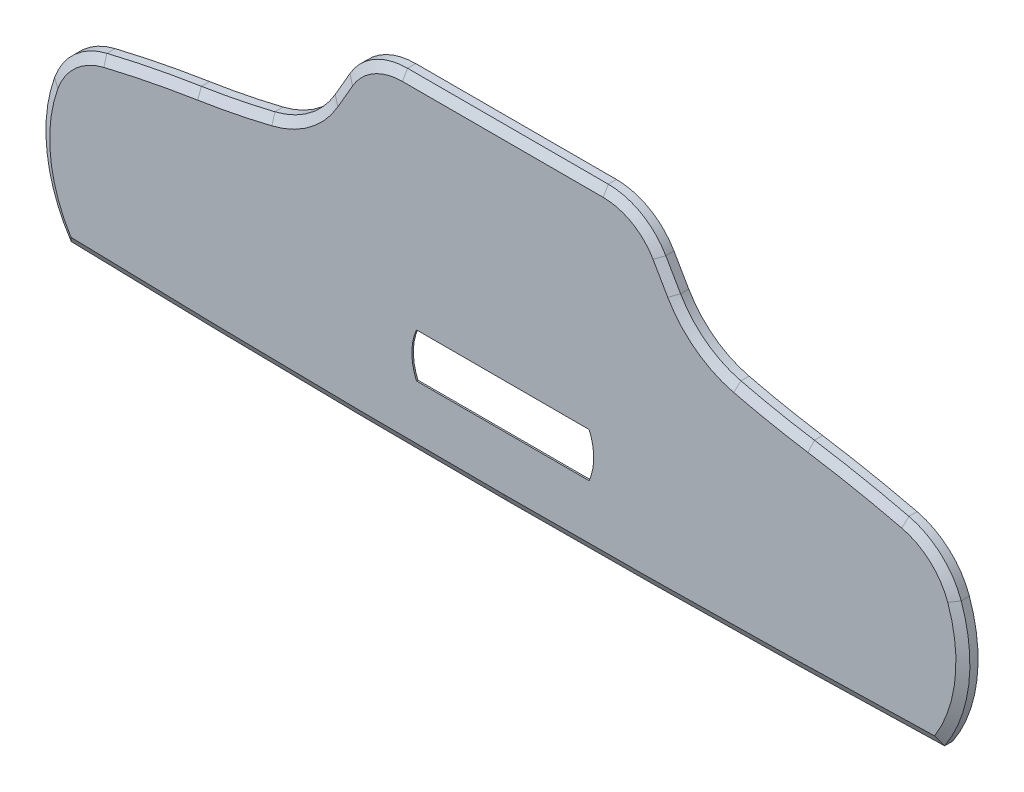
ISO-10303-21;
HEADER;
FILE_DESCRIPTION(('STEP AP214'),'2;1');
FILE_NAME('part.step','',(''),(''),'','','');
FILE_SCHEMA(('AUTOMOTIVE_DESIGN { 1 0 10303 214 1 1 1 1 }'));
ENDSEC;
DATA;
#1=APPLICATION_CONTEXT('core data for automotive mechanical design processes');
#2=APPLICATION_PROTOCOL_DEFINITION('international standard','automotive_design',2000,#1);
#3=PRODUCT_CONTEXT('',#1,'mechanical');
#4=PRODUCT('Part','Part','',(#3));
#5=PRODUCT_RELATED_PRODUCT_CATEGORY('part','',(#4));
#6=PRODUCT_DEFINITION_FORMATION('','',#4);
#7=PRODUCT_DEFINITION_CONTEXT('part definition',#1,'design');
#8=PRODUCT_DEFINITION('design','',#6,#7);
#9=PRODUCT_DEFINITION_SHAPE('','',#8);
#10=(LENGTH_UNIT() NAMED_UNIT(*) SI_UNIT(.MILLI.,.METRE.));
#11=(NAMED_UNIT(*) PLANE_ANGLE_UNIT() SI_UNIT($,.RADIAN.));
#12=(NAMED_UNIT(*) SI_UNIT($,.STERADIAN.) SOLID_ANGLE_UNIT());
#13=UNCERTAINTY_MEASURE_WITH_UNIT(LENGTH_MEASURE(1.E-05),#10,'distance_accuracy_value','');
#14=(GEOMETRIC_REPRESENTATION_CONTEXT(3) GLOBAL_UNCERTAINTY_ASSIGNED_CONTEXT((#13)) GLOBAL_UNIT_ASSIGNED_CONTEXT((#10,
#11,#12)) REPRESENTATION_CONTEXT('',''));
#15=CARTESIAN_POINT('',(0.,0.,0.));
#16=DIRECTION('',(0.,0.,1.));
#17=DIRECTION('',(1.,0.,0.));
#18=AXIS2_PLACEMENT_3D('',#15,#16,#17);
#19=CARTESIAN_POINT('',(0.,-1.,0.));
#20=DIRECTION('',(0.,-1.,0.));
#21=DIRECTION('',(0.,0.,-1.));
#22=AXIS2_PLACEMENT_3D('',#19,#20,#21);
#23=PLANE('',#22);
#24=DIRECTION('',(0.,0.,1.));
#25=VECTOR('',#24,1.);
#26=CARTESIAN_POINT('',(68.0000000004,-1.,4.5));
#27=LINE('',#26,#25);
#28=CARTESIAN_POINT('',(68.0000000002,-1.,0.));
#29=VERTEX_POINT('',#28);
#30=CARTESIAN_POINT('',(68.0000000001,-0.99999999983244,4.95854811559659));
#31=VERTEX_POINT('',#30);
#32=EDGE_CURVE('E302',#29,#31,#27,.T.);
#33=ORIENTED_EDGE('',*,*,#32,.T.);
#34=DIRECTION('',(1.,0.,0.));
#35=VECTOR('',#34,1.);
#36=CARTESIAN_POINT('',(-62.6,-0.99999999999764,4.95854811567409));
#37=LINE('',#36,#35);
#38=CARTESIAN_POINT('',(-68.,-0.999999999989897,4.9585481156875));
#39=VERTEX_POINT('',#38);
#40=EDGE_CURVE('E297',#31,#39,#37,.F.);
#41=ORIENTED_EDGE('',*,*,#40,.T.);
#42=DIRECTION('',(0.,0.,-1.));
#43=VECTOR('',#42,1.);
#44=CARTESIAN_POINT('',(-68.,-1.,4.5));
#45=LINE('',#44,#43);
#46=CARTESIAN_POINT('',(-68.,-1.,0.));
#47=VERTEX_POINT('',#46);
#48=EDGE_CURVE('E300',#39,#47,#45,.T.);
#49=ORIENTED_EDGE('',*,*,#48,.T.);
#50=DIRECTION('',(1.,0.,0.));
#51=VECTOR('',#50,1.);
#52=CARTESIAN_POINT('',(0.,-1.,0.));
#53=LINE('',#52,#51);
#54=EDGE_CURVE('E308',#47,#29,#53,.T.);
#55=ORIENTED_EDGE('',*,*,#54,.T.);
#56=EDGE_LOOP('',(#33,#41,#49,#55));
#57=FACE_BOUND('',#56,.T.);
#58=ADVANCED_FACE('F16',(#57),#23,.T.);
#59=CARTESIAN_POINT('',(-68.,-45.,4.5));
#60=DIRECTION('',(0.,0.,-1.));
#61=DIRECTION('',(-1.,0.,0.));
#62=AXIS2_PLACEMENT_3D('',#59,#60,#61);
#63=CYLINDRICAL_SURFACE('',#62,44.);
#64=DIRECTION('',(0.,0.,1.));
#65=VECTOR('',#64,1.);
#66=CARTESIAN_POINT('',(-106.105117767,-23.,0.));
#67=LINE('',#66,#65);
#68=CARTESIAN_POINT('',(-106.105117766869,-23.0000000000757,4.95854811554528));
#69=VERTEX_POINT('',#68);
#70=CARTESIAN_POINT('',(-106.105117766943,-22.9999999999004,0.));
#71=VERTEX_POINT('',#70);
#72=EDGE_CURVE('E317',#69,#71,#67,.F.);
#73=ORIENTED_EDGE('',*,*,#72,.T.);
#74=CARTESIAN_POINT('',(-68.,-45.,0.));
#75=DIRECTION('',(0.,0.,-1.));
#76=DIRECTION('',(-1.,0.,0.));
#77=AXIS2_PLACEMENT_3D('',#74,#75,#76);
#78=CIRCLE('',#77,44.);
#79=EDGE_CURVE('E315',#71,#47,#78,.T.);
#80=ORIENTED_EDGE('',*,*,#79,.T.);
#81=ORIENTED_EDGE('',*,*,#48,.F.);
#82=CARTESIAN_POINT('',(-68.,-45.,4.95854811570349));
#83=DIRECTION('',(0.,0.,-1.));
#84=DIRECTION('',(0.499999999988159,-0.866025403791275,0.));
#85=AXIS2_PLACEMENT_3D('',#82,#83,#84);
#86=CIRCLE('',#85,44.0000000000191);
#87=EDGE_CURVE('E307',#39,#69,#86,.F.);
#88=ORIENTED_EDGE('',*,*,#87,.T.);
#89=EDGE_LOOP('',(#73,#80,#81,#88));
#90=FACE_BOUND('',#89,.T.);
#91=ADVANCED_FACE('F311',(#90),#63,.F.);
#92=CARTESIAN_POINT('',(-106.105117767,-23.,0.));
#93=DIRECTION('',(-0.866025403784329,0.50000000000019,0.));
#94=DIRECTION('',(-0.50000000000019,-0.866025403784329,0.));
#95=AXIS2_PLACEMENT_3D('',#92,#93,#94);
#96=PLANE('',#95);
#97=DIRECTION('',(0.,0.,-1.));
#98=VECTOR('',#97,1.);
#99=CARTESIAN_POINT('',(-116.105117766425,-40.3205080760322,4.5));
#100=LINE('',#99,#98);
#101=CARTESIAN_POINT('',(-116.105117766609,-40.320508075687,0.));
#102=VERTEX_POINT('',#101);
#103=CARTESIAN_POINT('',(-116.105117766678,-40.320508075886,4.95854811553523));
#104=VERTEX_POINT('',#103);
#105=EDGE_CURVE('E1091',#102,#104,#100,.F.);
#106=ORIENTED_EDGE('',*,*,#105,.F.);
#107=DIRECTION('',(0.499999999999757,0.866025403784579,0.));
#108=VECTOR('',#107,1.);
#109=CARTESIAN_POINT('',(-116.105117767,-40.3205080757,0.));
#110=LINE('',#109,#108);
#111=EDGE_CURVE('E976',#102,#71,#110,.T.);
#112=ORIENTED_EDGE('',*,*,#111,.T.);
#113=ORIENTED_EDGE('',*,*,#72,.F.);
#114=DIRECTION('',(0.499999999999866,0.866025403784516,-2.164934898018E-13));
#115=VECTOR('',#114,1.);
#116=CARTESIAN_POINT('',(-116.105117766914,-40.32050807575,4.95854811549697));
#117=LINE('',#116,#115);
#118=EDGE_CURVE('E970',#104,#69,#117,.T.);
#119=ORIENTED_EDGE('',*,*,#118,.F.);
#120=EDGE_LOOP('',(#106,#112,#113,#119));
#121=FACE_BOUND('',#120,.T.);
#122=ADVANCED_FACE('F1103',(#121),#96,.F.);
#123=CARTESIAN_POINT('',(-173.262794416,-7.32050807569,4.5));
#124=DIRECTION('',(0.,0.,-1.));
#125=DIRECTION('',(-1.,0.,0.));
#126=AXIS2_PLACEMENT_3D('',#123,#124,#125);
#127=CYLINDRICAL_SURFACE('',#126,66.);
#128=DIRECTION('',(0.,0.,-1.));
#129=VECTOR('',#128,1.);
#130=CARTESIAN_POINT('',(-157.627924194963,-71.4418838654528,4.5));
#131=LINE('',#130,#129);
#132=CARTESIAN_POINT('',(-157.627924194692,-71.4418838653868,0.));
#133=VERTEX_POINT('',#132);
#134=CARTESIAN_POINT('',(-157.627924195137,-71.4418838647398,4.95854811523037));
#135=VERTEX_POINT('',#134);
#136=EDGE_CURVE('E1077',#133,#135,#131,.F.);
#137=ORIENTED_EDGE('',*,*,#136,.F.);
#138=CARTESIAN_POINT('',(-173.262794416,-7.32050807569,0.));
#139=DIRECTION('',(0.,0.,-1.));
#140=DIRECTION('',(-1.,0.,0.));
#141=AXIS2_PLACEMENT_3D('',#138,#139,#140);
#142=CIRCLE('',#141,66.);
#143=EDGE_CURVE('E979',#133,#102,#142,.F.);
#144=ORIENTED_EDGE('',*,*,#143,.T.);
#145=ORIENTED_EDGE('',*,*,#105,.T.);
#146=CARTESIAN_POINT('',(-173.262794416,-7.32050807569,4.95854811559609));
#147=DIRECTION('',(0.,0.,1.));
#148=DIRECTION('',(-0.735412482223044,0.67761971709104,0.));
#149=AXIS2_PLACEMENT_3D('',#146,#147,#148);
#150=CIRCLE('',#149,65.9999999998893);
#151=EDGE_CURVE('E1084',#135,#104,#150,.T.);
#152=ORIENTED_EDGE('',*,*,#151,.F.);
#153=EDGE_LOOP('',(#137,#144,#145,#152));
#154=FACE_BOUND('',#153,.T.);
#155=ADVANCED_FACE('F1926',(#154),#127,.T.);
#156=CARTESIAN_POINT('',(-300.,512.451250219,4.5));
#157=DIRECTION('',(0.,0.,-1.));
#158=DIRECTION('',(-1.,0.,0.));
#159=AXIS2_PLACEMENT_3D('',#156,#157,#158);
#160=CYLINDRICAL_SURFACE('',#159,601.);
#161=DIRECTION('',(0.,0.,-1.));
#162=VECTOR('',#161,1.);
#163=CARTESIAN_POINT('',(-207.506166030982,-81.3887035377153,4.5));
#164=LINE('',#163,#162);
#165=CARTESIAN_POINT('',(-207.506166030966,-81.3887035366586,4.95854811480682));
#166=VERTEX_POINT('',#165);
#167=CARTESIAN_POINT('',(-207.506166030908,-81.3887035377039,0.));
#168=VERTEX_POINT('',#167);
#169=EDGE_CURVE('E1070',#166,#168,#164,.T.);
#170=ORIENTED_EDGE('',*,*,#169,.T.);
#171=CARTESIAN_POINT('',(-300.,512.451250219,0.));
#172=DIRECTION('',(0.,0.,-1.));
#173=DIRECTION('',(-1.,0.,0.));
#174=AXIS2_PLACEMENT_3D('',#171,#172,#173);
#175=CIRCLE('',#174,601.);
#176=EDGE_CURVE('E1116',#168,#133,#175,.F.);
#177=ORIENTED_EDGE('',*,*,#176,.T.);
#178=ORIENTED_EDGE('',*,*,#136,.T.);
#179=CARTESIAN_POINT('',(-300.,512.451250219,4.95854811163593));
#180=DIRECTION('',(1.41119821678E-12,5.80888568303E-12,1.));
#181=DIRECTION('',(-0.0654618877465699,0.997855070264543,-5.70402912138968E-12));
#182=AXIS2_PLACEMENT_3D('',#179,#180,#181);
#183=CIRCLE('',#182,600.99999999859);
#184=EDGE_CURVE('E947',#166,#135,#183,.T.);
#185=ORIENTED_EDGE('',*,*,#184,.F.);
#186=EDGE_LOOP('',(#170,#177,#178,#185));
#187=FACE_BOUND('',#186,.T.);
#188=ADVANCED_FACE('F1917',(#187),#160,.T.);
#189=CARTESIAN_POINT('',(-84.5401538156,-870.869773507,4.5));
#190=DIRECTION('',(0.,0.,-1.));
#191=DIRECTION('',(-1.,0.,0.));
#192=AXIS2_PLACEMENT_3D('',#189,#190,#191);
#193=CYLINDRICAL_SURFACE('',#192,799.);
#194=DIRECTION('',(0.,0.,-1.));
#195=VECTOR('',#194,1.);
#196=CARTESIAN_POINT('',(-271.463376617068,-94.0424382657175,4.5));
#197=LINE('',#196,#195);
#198=CARTESIAN_POINT('',(-271.4633766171,-94.0424382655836,4.95854811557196));
#199=VERTEX_POINT('',#198);
#200=CARTESIAN_POINT('',(-271.463376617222,-94.0424382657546,0.));
#201=VERTEX_POINT('',#200);
#202=EDGE_CURVE('E1068',#199,#201,#197,.T.);
#203=ORIENTED_EDGE('',*,*,#202,.T.);
#204=CARTESIAN_POINT('',(-84.5401538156,-870.869773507,0.));
#205=DIRECTION('',(0.,0.,-1.));
#206=DIRECTION('',(-1.,0.,0.));
#207=AXIS2_PLACEMENT_3D('',#204,#205,#206);
#208=CIRCLE('',#207,799.);
#209=EDGE_CURVE('E1119',#201,#168,#208,.T.);
#210=ORIENTED_EDGE('',*,*,#209,.T.);
#211=ORIENTED_EDGE('',*,*,#169,.F.);
#212=CARTESIAN_POINT('',(-84.5401538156,-870.869773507,4.95854811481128));
#213=DIRECTION('',(0.,0.,-1.));
#214=DIRECTION('',(0.261831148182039,-0.965113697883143,0.));
#215=AXIS2_PLACEMENT_3D('',#212,#213,#214);
#216=CIRCLE('',#215,799.000000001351);
#217=EDGE_CURVE('E277',#166,#199,#216,.F.);
#218=ORIENTED_EDGE('',*,*,#217,.T.);
#219=EDGE_LOOP('',(#203,#210,#211,#218));
#220=FACE_BOUND('',#219,.T.);
#221=ADVANCED_FACE('F1908',(#220),#193,.F.);
#222=CARTESIAN_POINT('',(-260.,-141.68266283,4.5));
#223=DIRECTION('',(0.,0.,-1.));
#224=DIRECTION('',(-1.,0.,0.));
#225=AXIS2_PLACEMENT_3D('',#222,#223,#224);
#226=CYLINDRICAL_SURFACE('',#225,49.);
#227=ORIENTED_EDGE('',*,*,#202,.F.);
#228=CARTESIAN_POINT('',(-260.,-141.68266283,4.95854811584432));
#229=DIRECTION('',(0.,0.,-1.));
#230=DIRECTION('',(0.529955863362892,-0.848025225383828,0.));
#231=AXIS2_PLACEMENT_3D('',#228,#229,#230);
#232=CIRCLE('',#231,48.9999999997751);
#233=CARTESIAN_POINT('',(-306.173076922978,-125.280011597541,4.95854811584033));
#234=VERTEX_POINT('',#233);
#235=EDGE_CURVE('E269',#199,#234,#232,.F.);
#236=ORIENTED_EDGE('',*,*,#235,.T.);
#237=DIRECTION('',(0.,0.,-1.));
#238=VECTOR('',#237,1.);
#239=CARTESIAN_POINT('',(-306.173076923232,-125.280011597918,4.5));
#240=LINE('',#239,#238);
#241=CARTESIAN_POINT('',(-306.17307692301,-125.280011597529,0.));
#242=VERTEX_POINT('',#241);
#243=EDGE_CURVE('E19',#234,#242,#240,.T.);
#244=ORIENTED_EDGE('',*,*,#243,.T.);
#245=CARTESIAN_POINT('',(-260.,-141.68266283,0.));
#246=DIRECTION('',(0.,0.,-1.));
#247=DIRECTION('',(-1.,0.,0.));
#248=AXIS2_PLACEMENT_3D('',#245,#246,#247);
#249=CIRCLE('',#248,49.);
#250=EDGE_CURVE('E1122',#242,#201,#249,.T.);
#251=ORIENTED_EDGE('',*,*,#250,.T.);
#252=EDGE_LOOP('',(#227,#236,#244,#251));
#253=FACE_BOUND('',#252,.T.);
#254=ADVANCED_FACE('F1898',(#253),#226,.F.);
#255=CARTESIAN_POINT('',(-211.,-159.089558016,4.5));
#256=DIRECTION('',(0.,0.,-1.));
#257=DIRECTION('',(-1.,0.,0.));
#258=AXIS2_PLACEMENT_3D('',#255,#256,#257);
#259=CYLINDRICAL_SURFACE('',#258,101.);
#260=ORIENTED_EDGE('',*,*,#243,.F.);
#261=CARTESIAN_POINT('',(-211.,-159.089558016,4.95854811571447));
#262=DIRECTION('',(0.,0.,-1.));
#263=DIRECTION('',(0.,1.,0.));
#264=AXIS2_PLACEMENT_3D('',#261,#262,#263);
#265=CIRCLE('',#264,101.);
#266=CARTESIAN_POINT('',(-295.353360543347,-214.636930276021,4.95854809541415));
#267=VERTEX_POINT('',#266);
#268=EDGE_CURVE('E1113',#234,#267,#265,.F.);
#269=ORIENTED_EDGE('',*,*,#268,.T.);
#270=DIRECTION('',(0.,0.,1.));
#271=VECTOR('',#270,1.);
#272=CARTESIAN_POINT('',(-295.353359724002,-214.636931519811,4.5));
#273=LINE('',#272,#271);
#274=CARTESIAN_POINT('',(-295.35335972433,-214.636931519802,0.));
#275=VERTEX_POINT('',#274);
#276=EDGE_CURVE('E1052',#267,#275,#273,.F.);
#277=ORIENTED_EDGE('',*,*,#276,.T.);
#278=CARTESIAN_POINT('',(-211.,-159.089558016,0.));
#279=DIRECTION('',(0.,0.,-1.));
#280=DIRECTION('',(-1.,0.,0.));
#281=AXIS2_PLACEMENT_3D('',#278,#279,#280);
#282=CIRCLE('',#281,101.);
#283=EDGE_CURVE('E1125',#275,#242,#282,.T.);
#284=ORIENTED_EDGE('',*,*,#283,.T.);
#285=EDGE_LOOP('',(#260,#269,#277,#284));
#286=FACE_BOUND('',#285,.T.);
#287=ADVANCED_FACE('F1889',(#286),#259,.F.);
#288=CARTESIAN_POINT('',(-1.19441499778E-12,9780.,4.5));
#289=DIRECTION('',(0.,0.,1.));
#290=DIRECTION('',(1.,0.,0.));
#291=AXIS2_PLACEMENT_3D('',#288,#289,#290);
#292=CYLINDRICAL_SURFACE('',#291,9999.);
#293=CARTESIAN_POINT('',(8.57711607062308E-11,9780.00000000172,4.95855515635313));
#294=DIRECTION('',(1.47170744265E-11,5.63954189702E-10,-1.));
#295=DIRECTION('',(0.0156631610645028,0.999877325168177,5.64115542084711E-10));
#296=AXIS2_PLACEMENT_3D('',#293,#294,#295);
#297=CIRCLE('',#296,9998.99999756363);
#298=CARTESIAN_POINT('',(-2.60210381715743E-11,-218.999997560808,4.95854951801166));
#299=VERTEX_POINT('',#298);
#300=EDGE_CURVE('E1057',#267,#299,#297,.F.);
#301=ORIENTED_EDGE('',*,*,#300,.T.);
#302=CARTESIAN_POINT('',(-8.84115447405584E-11,9780.00000000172,4.95855515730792));
#303=DIRECTION('',(-1.47170744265E-11,5.63954189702E-10,-1.));
#304=DIRECTION('',(-0.0156631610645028,0.999877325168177,5.64115481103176E-10));
#305=AXIS2_PLACEMENT_3D('',#302,#303,#304);
#306=CIRCLE('',#305,9998.99999756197);
#307=CARTESIAN_POINT('',(295.353359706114,-214.636930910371,4.95854846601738));
#308=VERTEX_POINT('',#307);
#309=EDGE_CURVE('E891',#299,#308,#306,.F.);
#310=ORIENTED_EDGE('',*,*,#309,.T.);
#311=DIRECTION('',(0.,0.,1.));
#312=VECTOR('',#311,1.);
#313=CARTESIAN_POINT('',(295.353359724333,-214.636931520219,4.5));
#314=LINE('',#313,#312);
#315=CARTESIAN_POINT('',(295.353359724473,-214.636931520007,0.));
#316=VERTEX_POINT('',#315);
#317=EDGE_CURVE('E1043',#308,#316,#314,.F.);
#318=ORIENTED_EDGE('',*,*,#317,.T.);
#319=CARTESIAN_POINT('',(-1.19441499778E-12,9780.,0.));
#320=DIRECTION('',(0.,0.,1.));
#321=DIRECTION('',(1.,0.,0.));
#322=AXIS2_PLACEMENT_3D('',#319,#320,#321);
#323=CIRCLE('',#322,9999.);
#324=EDGE_CURVE('E1128',#316,#275,#323,.F.);
#325=ORIENTED_EDGE('',*,*,#324,.T.);
#326=ORIENTED_EDGE('',*,*,#276,.F.);
#327=EDGE_LOOP('',(#301,#310,#318,#325,#326));
#328=FACE_BOUND('',#327,.T.);
#329=ADVANCED_FACE('F1880',(#328),#292,.F.);
#330=CARTESIAN_POINT('',(211.,-159.089558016,4.5));
#331=DIRECTION('',(0.,0.,1.));
#332=DIRECTION('',(1.,0.,0.));
#333=AXIS2_PLACEMENT_3D('',#330,#331,#332);
#334=CYLINDRICAL_SURFACE('',#333,101.);
#335=CARTESIAN_POINT('',(211.,-159.089558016,0.));
#336=DIRECTION('',(0.,0.,1.));
#337=DIRECTION('',(1.,0.,0.));
#338=AXIS2_PLACEMENT_3D('',#335,#336,#337);
#339=CIRCLE('',#338,101.);
#340=CARTESIAN_POINT('',(306.173076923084,-125.280011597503,0.));
#341=VERTEX_POINT('',#340);
#342=EDGE_CURVE('E1131',#341,#316,#339,.F.);
#343=ORIENTED_EDGE('',*,*,#342,.T.);
#344=ORIENTED_EDGE('',*,*,#317,.F.);
#345=CARTESIAN_POINT('',(211.,-159.089558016,4.95854811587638));
#346=DIRECTION('',(0.,0.,-1.));
#347=DIRECTION('',(-0.563632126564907,0.826025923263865,0.));
#348=AXIS2_PLACEMENT_3D('',#345,#346,#347);
#349=CIRCLE('',#348,100.99999999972);
#350=CARTESIAN_POINT('',(306.173076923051,-125.280011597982,4.95854811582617));
#351=VERTEX_POINT('',#350);
#352=EDGE_CURVE('E1046',#308,#351,#349,.F.);
#353=ORIENTED_EDGE('',*,*,#352,.T.);
#354=DIRECTION('',(0.,0.,1.));
#355=VECTOR('',#354,1.);
#356=CARTESIAN_POINT('',(306.173076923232,-125.280011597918,4.5));
#357=LINE('',#356,#355);
#358=EDGE_CURVE('E1035',#351,#341,#357,.F.);
#359=ORIENTED_EDGE('',*,*,#358,.T.);
#360=EDGE_LOOP('',(#343,#344,#353,#359));
#361=FACE_BOUND('',#360,.T.);
#362=ADVANCED_FACE('F1870',(#361),#334,.F.);
#363=CARTESIAN_POINT('',(260.,-141.68266283,4.5));
#364=DIRECTION('',(0.,0.,1.));
#365=DIRECTION('',(1.,0.,0.));
#366=AXIS2_PLACEMENT_3D('',#363,#364,#365);
#367=CYLINDRICAL_SURFACE('',#366,49.);
#368=CARTESIAN_POINT('',(260.,-141.68266283,0.));
#369=DIRECTION('',(0.,0.,1.));
#370=DIRECTION('',(1.,0.,0.));
#371=AXIS2_PLACEMENT_3D('',#368,#369,#370);
#372=CIRCLE('',#371,49.);
#373=CARTESIAN_POINT('',(271.46337661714,-94.0424382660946,0.));
#374=VERTEX_POINT('',#373);
#375=EDGE_CURVE('E1134',#374,#341,#372,.F.);
#376=ORIENTED_EDGE('',*,*,#375,.T.);
#377=ORIENTED_EDGE('',*,*,#358,.F.);
#378=CARTESIAN_POINT('',(260.,-141.68266283,4.95854811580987));
#379=DIRECTION('',(0.,0.,-1.));
#380=DIRECTION('',(-0.529955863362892,-0.848025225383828,0.));
#381=AXIS2_PLACEMENT_3D('',#378,#379,#380);
#382=CIRCLE('',#381,48.9999999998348);
#383=CARTESIAN_POINT('',(271.463376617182,-94.0424382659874,4.95854811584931));
#384=VERTEX_POINT('',#383);
#385=EDGE_CURVE('E850',#351,#384,#382,.F.);
#386=ORIENTED_EDGE('',*,*,#385,.T.);
#387=DIRECTION('',(0.,0.,1.));
#388=VECTOR('',#387,1.);
#389=CARTESIAN_POINT('',(271.463376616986,-94.0424382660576,4.5));
#390=LINE('',#389,#388);
#391=EDGE_CURVE('E1031',#384,#374,#390,.F.);
#392=ORIENTED_EDGE('',*,*,#391,.T.);
#393=EDGE_LOOP('',(#376,#377,#386,#392));
#394=FACE_BOUND('',#393,.T.);
#395=ADVANCED_FACE('F1860',(#394),#367,.F.);
#396=CARTESIAN_POINT('',(84.5401538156,-870.869773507,4.5));
#397=DIRECTION('',(0.,0.,1.));
#398=DIRECTION('',(1.,0.,0.));
#399=AXIS2_PLACEMENT_3D('',#396,#397,#398);
#400=CYLINDRICAL_SURFACE('',#399,799.);
#401=CARTESIAN_POINT('',(84.5401538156,-870.869773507,0.));
#402=DIRECTION('',(0.,0.,1.));
#403=DIRECTION('',(1.,0.,0.));
#404=AXIS2_PLACEMENT_3D('',#401,#402,#403);
#405=CIRCLE('',#404,799.);
#406=CARTESIAN_POINT('',(207.506166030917,-81.3887035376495,0.));
#407=VERTEX_POINT('',#406);
#408=EDGE_CURVE('E1137',#407,#374,#405,.F.);
#409=ORIENTED_EDGE('',*,*,#408,.T.);
#410=ORIENTED_EDGE('',*,*,#391,.F.);
#411=CARTESIAN_POINT('',(84.5401538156,-870.869773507,4.95854811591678));
#412=DIRECTION('',(0.,0.,-1.));
#413=DIRECTION('',(-0.261831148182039,-0.965113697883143,0.));
#414=AXIS2_PLACEMENT_3D('',#411,#412,#413);
#415=CIRCLE('',#414,799.000000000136);
#416=CARTESIAN_POINT('',(207.506166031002,-81.388703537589,4.95854811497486));
#417=VERTEX_POINT('',#416);
#418=EDGE_CURVE('E849',#384,#417,#415,.F.);
#419=ORIENTED_EDGE('',*,*,#418,.T.);
#420=DIRECTION('',(0.,0.,1.));
#421=VECTOR('',#420,1.);
#422=CARTESIAN_POINT('',(207.50616603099,-81.388703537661,4.5));
#423=LINE('',#422,#421);
#424=EDGE_CURVE('E1022',#407,#417,#423,.T.);
#425=ORIENTED_EDGE('',*,*,#424,.F.);
#426=EDGE_LOOP('',(#409,#410,#419,#425));
#427=FACE_BOUND('',#426,.T.);
#428=ADVANCED_FACE('F1850',(#427),#400,.F.);
#429=CARTESIAN_POINT('',(300.,512.451250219,4.5));
#430=DIRECTION('',(0.,0.,1.));
#431=DIRECTION('',(1.,0.,0.));
#432=AXIS2_PLACEMENT_3D('',#429,#430,#431);
#433=CYLINDRICAL_SURFACE('',#432,601.);
#434=ORIENTED_EDGE('',*,*,#424,.T.);
#435=CARTESIAN_POINT('',(300.,512.451250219,4.95854811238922));
#436=DIRECTION('',(-1.41119821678E-12,5.80888568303E-12,1.));
#437=DIRECTION('',(0.06546188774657,0.997855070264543,-5.70411571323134E-12));
#438=AXIS2_PLACEMENT_3D('',#435,#436,#437);
#439=CIRCLE('',#438,600.999999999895);
#440=CARTESIAN_POINT('',(157.627924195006,-71.4418838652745,4.9585481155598));
#441=VERTEX_POINT('',#440);
#442=EDGE_CURVE('E843',#441,#417,#439,.T.);
#443=ORIENTED_EDGE('',*,*,#442,.F.);
#444=DIRECTION('',(0.,0.,1.));
#445=VECTOR('',#444,1.);
#446=CARTESIAN_POINT('',(157.627924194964,-71.441883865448,4.5));
#447=LINE('',#446,#445);
#448=CARTESIAN_POINT('',(157.627924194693,-71.4418838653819,0.));
#449=VERTEX_POINT('',#448);
#450=EDGE_CURVE('E1009',#449,#441,#447,.T.);
#451=ORIENTED_EDGE('',*,*,#450,.F.);
#452=CARTESIAN_POINT('',(300.,512.451250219,0.));
#453=DIRECTION('',(0.,0.,1.));
#454=DIRECTION('',(1.,0.,0.));
#455=AXIS2_PLACEMENT_3D('',#452,#453,#454);
#456=CIRCLE('',#455,601.);
#457=EDGE_CURVE('E1140',#449,#407,#456,.T.);
#458=ORIENTED_EDGE('',*,*,#457,.T.);
#459=EDGE_LOOP('',(#434,#443,#451,#458));
#460=FACE_BOUND('',#459,.T.);
#461=ADVANCED_FACE('F1840',(#460),#433,.T.);
#462=CARTESIAN_POINT('',(173.262794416,-7.32050807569,4.5));
#463=DIRECTION('',(0.,0.,1.));
#464=DIRECTION('',(1.,0.,0.));
#465=AXIS2_PLACEMENT_3D('',#462,#463,#464);
#466=CYLINDRICAL_SURFACE('',#465,66.);
#467=ORIENTED_EDGE('',*,*,#450,.T.);
#468=CARTESIAN_POINT('',(173.262794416,-7.32050807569,4.95854811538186));
#469=DIRECTION('',(0.,0.,1.));
#470=DIRECTION('',(0.735412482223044,0.67761971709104,0.));
#471=AXIS2_PLACEMENT_3D('',#468,#469,#470);
#472=CIRCLE('',#471,65.9999999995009);
#473=CARTESIAN_POINT('',(116.105117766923,-40.3205080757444,4.95854811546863));
#474=VERTEX_POINT('',#473);
#475=EDGE_CURVE('E842',#474,#441,#472,.T.);
#476=ORIENTED_EDGE('',*,*,#475,.F.);
#477=DIRECTION('',(0.,0.,1.));
#478=VECTOR('',#477,1.);
#479=CARTESIAN_POINT('',(116.105117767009,-40.320508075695,0.));
#480=LINE('',#479,#478);
#481=CARTESIAN_POINT('',(116.105117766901,-40.3205080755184,0.));
#482=VERTEX_POINT('',#481);
#483=EDGE_CURVE('E1000',#482,#474,#480,.T.);
#484=ORIENTED_EDGE('',*,*,#483,.F.);
#485=CARTESIAN_POINT('',(173.262794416,-7.32050807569,0.));
#486=DIRECTION('',(0.,0.,1.));
#487=DIRECTION('',(1.,0.,0.));
#488=AXIS2_PLACEMENT_3D('',#485,#486,#487);
#489=CIRCLE('',#488,66.);
#490=EDGE_CURVE('E983',#482,#449,#489,.T.);
#491=ORIENTED_EDGE('',*,*,#490,.T.);
#492=EDGE_LOOP('',(#467,#476,#484,#491));
#493=FACE_BOUND('',#492,.T.);
#494=ADVANCED_FACE('F1831',(#493),#466,.T.);
#495=CARTESIAN_POINT('',(106.105117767,-23.,0.));
#496=DIRECTION('',(-0.866025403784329,-0.50000000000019,0.));
#497=DIRECTION('',(0.50000000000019,-0.866025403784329,0.));
#498=AXIS2_PLACEMENT_3D('',#495,#496,#497);
#499=PLANE('',#498);
#500=ORIENTED_EDGE('',*,*,#483,.T.);
#501=DIRECTION('',(-0.499999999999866,0.866025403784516,-2.164934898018E-13));
#502=VECTOR('',#501,1.);
#503=CARTESIAN_POINT('',(116.105117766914,-40.32050807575,4.95854811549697));
#504=LINE('',#503,#502);
#505=CARTESIAN_POINT('',(106.10511776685,-23.0000000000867,4.95854811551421));
#506=VERTEX_POINT('',#505);
#507=EDGE_CURVE('E818',#474,#506,#504,.T.);
#508=ORIENTED_EDGE('',*,*,#507,.T.);
#509=DIRECTION('',(0.,0.,1.));
#510=VECTOR('',#509,1.);
#511=CARTESIAN_POINT('',(106.105117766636,-23.0000000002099,4.5));
#512=LINE('',#511,#510);
#513=CARTESIAN_POINT('',(106.105117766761,-23.0000000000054,0.));
#514=VERTEX_POINT('',#513);
#515=EDGE_CURVE('E996',#506,#514,#512,.F.);
#516=ORIENTED_EDGE('',*,*,#515,.T.);
#517=DIRECTION('',(0.499999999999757,-0.866025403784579,0.));
#518=VECTOR('',#517,1.);
#519=CARTESIAN_POINT('',(106.105117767,-23.,0.));
#520=LINE('',#519,#518);
#521=EDGE_CURVE('E980',#514,#482,#520,.T.);
#522=ORIENTED_EDGE('',*,*,#521,.T.);
#523=EDGE_LOOP('',(#500,#508,#516,#522));
#524=FACE_BOUND('',#523,.T.);
#525=ADVANCED_FACE('F1154',(#524),#499,.T.);
#526=CARTESIAN_POINT('',(68.,-45.,4.5));
#527=DIRECTION('',(0.,0.,1.));
#528=DIRECTION('',(1.,0.,0.));
#529=AXIS2_PLACEMENT_3D('',#526,#527,#528);
#530=CYLINDRICAL_SURFACE('',#529,44.);
#531=CARTESIAN_POINT('',(68.,-45.,0.));
#532=DIRECTION('',(0.,0.,1.));
#533=DIRECTION('',(1.,0.,0.));
#534=AXIS2_PLACEMENT_3D('',#531,#532,#533);
#535=CIRCLE('',#534,44.);
#536=EDGE_CURVE('E984',#29,#514,#535,.F.);
#537=ORIENTED_EDGE('',*,*,#536,.T.);
#538=ORIENTED_EDGE('',*,*,#515,.F.);
#539=CARTESIAN_POINT('',(68.,-45.,4.95854811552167));
#540=DIRECTION('',(0.,0.,-1.));
#541=DIRECTION('',(-0.499999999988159,-0.866025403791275,0.));
#542=AXIS2_PLACEMENT_3D('',#539,#540,#541);
#543=CIRCLE('',#542,44.000000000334);
#544=EDGE_CURVE('E991',#506,#31,#543,.F.);
#545=ORIENTED_EDGE('',*,*,#544,.T.);
#546=ORIENTED_EDGE('',*,*,#32,.F.);
#547=EDGE_LOOP('',(#537,#538,#545,#546));
#548=FACE_BOUND('',#547,.T.);
#549=ADVANCED_FACE('F1148',(#548),#530,.F.);
#550=CARTESIAN_POINT('',(0.,0.,0.));
#551=DIRECTION('',(0.,0.,1.));
#552=DIRECTION('',(1.,0.,0.));
#553=AXIS2_PLACEMENT_3D('',#550,#551,#552);
#554=PLANE('',#553);
#555=ORIENTED_EDGE('',*,*,#79,.F.);
#556=ORIENTED_EDGE('',*,*,#111,.F.);
#557=ORIENTED_EDGE('',*,*,#143,.F.);
#558=ORIENTED_EDGE('',*,*,#176,.F.);
#559=ORIENTED_EDGE('',*,*,#209,.F.);
#560=ORIENTED_EDGE('',*,*,#250,.F.);
#561=ORIENTED_EDGE('',*,*,#283,.F.);
#562=ORIENTED_EDGE('',*,*,#324,.F.);
#563=ORIENTED_EDGE('',*,*,#342,.F.);
#564=ORIENTED_EDGE('',*,*,#375,.F.);
#565=ORIENTED_EDGE('',*,*,#408,.F.);
#566=ORIENTED_EDGE('',*,*,#457,.F.);
#567=ORIENTED_EDGE('',*,*,#490,.F.);
#568=ORIENTED_EDGE('',*,*,#521,.F.);
#569=ORIENTED_EDGE('',*,*,#536,.F.);
#570=ORIENTED_EDGE('',*,*,#54,.F.);
#571=EDGE_LOOP('',(#555,#556,#557,#558,#559,#560,#561,#562,#563,#564,#565,#566,#567,#568,#569,#570));
#572=FACE_BOUND('',#571,.T.);
#573=CARTESIAN_POINT('',(-211.,-159.089558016,0.));
#574=DIRECTION('',(0.,0.,-1.));
#575=DIRECTION('',(-1.,0.,0.));
#576=AXIS2_PLACEMENT_3D('',#573,#574,#575);
#577=CIRCLE('',#576,102.);
#578=CARTESIAN_POINT('',(-307.115384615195,-124.945263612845,0.));
#579=VERTEX_POINT('',#578);
#580=CARTESIAN_POINT('',(-295.900981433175,-215.621171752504,0.));
#581=VERTEX_POINT('',#580);
#582=EDGE_CURVE('E647',#579,#581,#577,.F.);
#583=ORIENTED_EDGE('',*,*,#582,.F.);
#584=CARTESIAN_POINT('',(-260.,-141.68266283,0.));
#585=DIRECTION('',(0.,0.,-1.));
#586=DIRECTION('',(-1.,0.,0.));
#587=AXIS2_PLACEMENT_3D('',#584,#585,#586);
#588=CIRCLE('',#587,50.);
#589=CARTESIAN_POINT('',(-271.697323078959,-93.0701887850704,0.));
#590=VERTEX_POINT('',#589);
#591=EDGE_CURVE('E648',#590,#579,#588,.F.);
#592=ORIENTED_EDGE('',*,*,#591,.F.);
#593=CARTESIAN_POINT('',(-84.5401538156,-870.869773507,0.));
#594=DIRECTION('',(0.,0.,-1.));
#595=DIRECTION('',(-1.,0.,0.));
#596=AXIS2_PLACEMENT_3D('',#593,#594,#595);
#597=CIRCLE('',#596,800.);
#598=CARTESIAN_POINT('',(-207.660065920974,-80.4006170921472,0.));
#599=VERTEX_POINT('',#598);
#600=EDGE_CURVE('E658',#599,#590,#597,.F.);
#601=ORIENTED_EDGE('',*,*,#600,.F.);
#602=CARTESIAN_POINT('',(-300.,512.451250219,0.));
#603=DIRECTION('',(0.,0.,-1.));
#604=DIRECTION('',(-1.,0.,0.));
#605=AXIS2_PLACEMENT_3D('',#602,#603,#604);
#606=CIRCLE('',#605,600.);
#607=CARTESIAN_POINT('',(-157.864816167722,-70.4703478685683,0.));
#608=VERTEX_POINT('',#607);
#609=EDGE_CURVE('E682',#599,#608,#606,.F.);
#610=ORIENTED_EDGE('',*,*,#609,.T.);
#611=CARTESIAN_POINT('',(-173.262794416,-7.32050807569,0.));
#612=DIRECTION('',(0.,0.,-1.));
#613=DIRECTION('',(-1.,0.,0.));
#614=AXIS2_PLACEMENT_3D('',#611,#612,#613);
#615=CIRCLE('',#614,65.);
#616=CARTESIAN_POINT('',(-116.971143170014,-39.8205080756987,0.));
#617=VERTEX_POINT('',#616);
#618=EDGE_CURVE('E692',#608,#617,#615,.F.);
#619=ORIENTED_EDGE('',*,*,#618,.T.);
#620=DIRECTION('',(-0.50000000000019,-0.866025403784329,0.));
#621=VECTOR('',#620,1.);
#622=CARTESIAN_POINT('',(-106.97114317,-22.5,0.));
#623=LINE('',#622,#621);
#624=CARTESIAN_POINT('',(-106.971143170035,-22.5000000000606,0.));
#625=VERTEX_POINT('',#624);
#626=EDGE_CURVE('E702',#625,#617,#623,.T.);
#627=ORIENTED_EDGE('',*,*,#626,.F.);
#628=CARTESIAN_POINT('',(-68.,-45.,0.));
#629=DIRECTION('',(0.,0.,-1.));
#630=DIRECTION('',(-1.,0.,0.));
#631=AXIS2_PLACEMENT_3D('',#628,#629,#630);
#632=CIRCLE('',#631,45.);
#633=CARTESIAN_POINT('',(-68.,0.,0.));
#634=VERTEX_POINT('',#633);
#635=EDGE_CURVE('E703',#634,#625,#632,.F.);
#636=ORIENTED_EDGE('',*,*,#635,.F.);
#637=DIRECTION('',(1.,0.,0.));
#638=VECTOR('',#637,1.);
#639=CARTESIAN_POINT('',(0.,0.,0.));
#640=LINE('',#639,#638);
#641=CARTESIAN_POINT('',(68.,0.,0.));
#642=VERTEX_POINT('',#641);
#643=EDGE_CURVE('E718',#634,#642,#640,.T.);
#644=ORIENTED_EDGE('',*,*,#643,.T.);
#645=CARTESIAN_POINT('',(68.,-45.,0.));
#646=DIRECTION('',(0.,0.,1.));
#647=DIRECTION('',(1.,0.,0.));
#648=AXIS2_PLACEMENT_3D('',#645,#646,#647);
#649=CIRCLE('',#648,45.);
#650=CARTESIAN_POINT('',(106.971143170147,-22.4999999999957,0.));
#651=VERTEX_POINT('',#650);
#652=EDGE_CURVE('E728',#651,#642,#649,.T.);
#653=ORIENTED_EDGE('',*,*,#652,.F.);
#654=DIRECTION('',(0.50000000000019,-0.866025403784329,0.));
#655=VECTOR('',#654,1.);
#656=CARTESIAN_POINT('',(106.97114317,-22.5,0.));
#657=LINE('',#656,#655);
#658=CARTESIAN_POINT('',(116.971143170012,-39.8205080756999,0.));
#659=VERTEX_POINT('',#658);
#660=EDGE_CURVE('E738',#651,#659,#657,.T.);
#661=ORIENTED_EDGE('',*,*,#660,.T.);
#662=CARTESIAN_POINT('',(173.262794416,-7.32050807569,0.));
#663=DIRECTION('',(0.,0.,1.));
#664=DIRECTION('',(1.,0.,0.));
#665=AXIS2_PLACEMENT_3D('',#662,#663,#664);
#666=CIRCLE('',#665,65.);
#667=CARTESIAN_POINT('',(157.864816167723,-70.4703478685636,0.));
#668=VERTEX_POINT('',#667);
#669=EDGE_CURVE('E755',#659,#668,#666,.T.);
#670=ORIENTED_EDGE('',*,*,#669,.T.);
#671=CARTESIAN_POINT('',(300.,512.451250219,0.));
#672=DIRECTION('',(0.,0.,1.));
#673=DIRECTION('',(1.,0.,0.));
#674=AXIS2_PLACEMENT_3D('',#671,#672,#673);
#675=CIRCLE('',#674,600.);
#676=CARTESIAN_POINT('',(207.660065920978,-80.40061709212,0.));
#677=VERTEX_POINT('',#676);
#678=EDGE_CURVE('E765',#668,#677,#675,.T.);
#679=ORIENTED_EDGE('',*,*,#678,.T.);
#680=CARTESIAN_POINT('',(84.5401538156,-870.869773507,0.));
#681=DIRECTION('',(0.,0.,1.));
#682=DIRECTION('',(1.,0.,0.));
#683=AXIS2_PLACEMENT_3D('',#680,#681,#682);
#684=CIRCLE('',#683,800.);
#685=CARTESIAN_POINT('',(271.697323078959,-93.0701887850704,0.));
#686=VERTEX_POINT('',#685);
#687=EDGE_CURVE('E771',#686,#677,#684,.T.);
#688=ORIENTED_EDGE('',*,*,#687,.F.);
#689=CARTESIAN_POINT('',(260.,-141.68266283,0.));
#690=DIRECTION('',(0.,0.,1.));
#691=DIRECTION('',(1.,0.,0.));
#692=AXIS2_PLACEMENT_3D('',#689,#690,#691);
#693=CIRCLE('',#692,50.);
#694=CARTESIAN_POINT('',(307.115384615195,-124.945263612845,0.));
#695=VERTEX_POINT('',#694);
#696=EDGE_CURVE('E772',#695,#686,#693,.T.);
#697=ORIENTED_EDGE('',*,*,#696,.F.);
#698=CARTESIAN_POINT('',(211.,-159.089558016,0.));
#699=DIRECTION('',(0.,0.,1.));
#700=DIRECTION('',(1.,0.,0.));
#701=AXIS2_PLACEMENT_3D('',#698,#699,#700);
#702=CIRCLE('',#701,102.);
#703=CARTESIAN_POINT('',(295.900981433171,-215.621171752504,0.));
#704=VERTEX_POINT('',#703);
#705=EDGE_CURVE('E783',#704,#695,#702,.T.);
#706=ORIENTED_EDGE('',*,*,#705,.F.);
#707=CARTESIAN_POINT('',(-1.19441499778E-12,9780.,0.));
#708=DIRECTION('',(0.,0.,1.));
#709=DIRECTION('',(1.,0.,0.));
#710=AXIS2_PLACEMENT_3D('',#707,#708,#709);
#711=CIRCLE('',#710,10000.);
#712=EDGE_CURVE('E619',#581,#704,#711,.T.);
#713=ORIENTED_EDGE('',*,*,#712,.F.);
#714=EDGE_LOOP('',(#583,#592,#601,#610,#619,#627,#636,#644,#653,#661,#670,#679,#688,#697,#706,#713));
#715=FACE_BOUND('',#714,.T.);
#716=ADVANCED_FACE('F1107',(#572,#715),#554,.F.);
#717=CARTESIAN_POINT('',(-62.6,-6.5,8.13397459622));
#718=DIRECTION('',(0.,0.50000000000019,0.866025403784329));
#719=DIRECTION('',(0.,-0.866025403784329,0.50000000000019));
#720=AXIS2_PLACEMENT_3D('',#717,#718,#719);
#721=PLANE('',#720);
#722=DIRECTION('',(1.,0.,0.));
#723=VECTOR('',#722,1.);
#724=CARTESIAN_POINT('',(0.,-6.26794919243,8.));
#725=LINE('',#724,#723);
#726=CARTESIAN_POINT('',(68.,-6.26794919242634,8.00000000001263));
#727=VERTEX_POINT('',#726);
#728=CARTESIAN_POINT('',(-68.,-6.26794919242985,8.00000000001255));
#729=VERTEX_POINT('',#728);
#730=EDGE_CURVE('E323',#727,#729,#725,.F.);
#731=ORIENTED_EDGE('',*,*,#730,.T.);
#732=DIRECTION('',(0.,-0.866025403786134,0.499999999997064));
#733=VECTOR('',#732,1.);
#734=CARTESIAN_POINT('',(-68.,-6.26794919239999,7.99999999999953));
#735=LINE('',#734,#733);
#736=EDGE_CURVE('E320',#729,#39,#735,.F.);
#737=ORIENTED_EDGE('',*,*,#736,.T.);
#738=ORIENTED_EDGE('',*,*,#40,.F.);
#739=DIRECTION('',(0.,-0.866025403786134,0.499999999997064));
#740=VECTOR('',#739,1.);
#741=CARTESIAN_POINT('',(68.,-6.26794919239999,7.99999999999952));
#742=LINE('',#741,#740);
#743=EDGE_CURVE('E794',#31,#727,#742,.T.);
#744=ORIENTED_EDGE('',*,*,#743,.T.);
#745=EDGE_LOOP('',(#731,#737,#738,#744));
#746=FACE_BOUND('',#745,.T.);
#747=ADVANCED_FACE('F321',(#746),#721,.F.);
#748=CARTESIAN_POINT('',(-68.,-45.,4.95854811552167));
#749=DIRECTION('',(0.,0.,-1.));
#750=DIRECTION('',(0.,1.,0.));
#751=AXIS2_PLACEMENT_3D('',#748,#749,#750);
#752=CONICAL_SURFACE('',#751,44.000000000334,1.0471975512);
#753=CARTESIAN_POINT('',(-68.,-45.,8.00000000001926));
#754=DIRECTION('',(0.,0.,-1.));
#755=DIRECTION('',(0.,1.,0.));
#756=AXIS2_PLACEMENT_3D('',#753,#754,#755);
#757=CIRCLE('',#756,38.7320508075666);
#758=CARTESIAN_POINT('',(-101.54293994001,-25.6339745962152,8.00000000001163));
#759=VERTEX_POINT('',#758);
#760=EDGE_CURVE('E617',#729,#759,#757,.F.);
#761=ORIENTED_EDGE('',*,*,#760,.T.);
#762=DIRECTION('',(0.750000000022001,-0.433012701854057,0.500000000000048));
#763=VECTOR('',#762,1.);
#764=CARTESIAN_POINT('',(-106.105117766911,-23.0000000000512,4.95854811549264));
#765=LINE('',#764,#763);
#766=EDGE_CURVE('E326',#69,#759,#765,.T.);
#767=ORIENTED_EDGE('',*,*,#766,.F.);
#768=ORIENTED_EDGE('',*,*,#87,.F.);
#769=ORIENTED_EDGE('',*,*,#736,.F.);
#770=EDGE_LOOP('',(#761,#767,#768,#769));
#771=FACE_BOUND('',#770,.T.);
#772=ADVANCED_FACE('F328',(#771),#752,.F.);
#773=CARTESIAN_POINT('',(-61.216134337,43.75,8.13397459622));
#774=DIRECTION('',(0.433012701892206,-0.250000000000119,-0.866025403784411));
#775=DIRECTION('',(-0.894427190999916,0.,-0.447213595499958));
#776=AXIS2_PLACEMENT_3D('',#773,#774,#775);
#777=PLANE('',#776);
#778=CARTESIAN_POINT('',(-116.105117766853,-40.3205080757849,4.95854811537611));
#779=CARTESIAN_POINT('',(-115.915027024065,-40.430257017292,5.08527527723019));
#780=CARTESIAN_POINT('',(-115.724936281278,-40.540005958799,5.21200243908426));
#781=CARTESIAN_POINT('',(-115.344754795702,-40.7595038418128,5.4654567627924));
#782=CARTESIAN_POINT('',(-115.154664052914,-40.8692527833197,5.59218392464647));
#783=CARTESIAN_POINT('',(-114.774482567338,-41.0887506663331,5.84563824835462));
#784=CARTESIAN_POINT('',(-114.58439182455,-41.1984996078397,5.9723654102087));
#785=CARTESIAN_POINT('',(-114.204210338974,-41.4179974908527,6.22581973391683));
#786=CARTESIAN_POINT('',(-114.014119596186,-41.5277464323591,6.35254689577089));
#787=CARTESIAN_POINT('',(-113.63393811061,-41.7472443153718,6.60600121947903));
#788=CARTESIAN_POINT('',(-113.443847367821,-41.856993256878,6.73272838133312));
#789=CARTESIAN_POINT('',(-113.063665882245,-42.0764911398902,6.98618270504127));
#790=CARTESIAN_POINT('',(-112.873575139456,-42.1862400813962,7.11290986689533));
#791=CARTESIAN_POINT('',(-112.49339365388,-42.4057379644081,7.36636419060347));
#792=CARTESIAN_POINT('',(-112.303302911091,-42.5154869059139,7.49309135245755));
#793=CARTESIAN_POINT('',(-111.923121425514,-42.7349847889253,7.7465456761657));
#794=CARTESIAN_POINT('',(-111.733030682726,-42.8447337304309,7.87327283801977));
#795=CARTESIAN_POINT('',(-111.542939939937,-42.9544826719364,7.99999999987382));
#796=B_SPLINE_CURVE_WITH_KNOTS('',3,(#778,#779,#780,#781,#782,#783,#784,#785,#786,#787,#788,
#789,#790,#791,#792,#793,#794,#795),.UNSPECIFIED.,.F.,.F.,(4,2,2,2,2,2,2,2,4),(0.,
0.760362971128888,1.52072594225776,2.28108891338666,3.04145188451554,3.80181485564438,
4.56217782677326,5.32254079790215,6.08290376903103),.UNSPECIFIED.);
#797=CARTESIAN_POINT('',(-111.542939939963,-42.9544826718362,7.99999999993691));
#798=VERTEX_POINT('',#797);
#799=EDGE_CURVE('E952',#104,#798,#796,.T.);
#800=ORIENTED_EDGE('',*,*,#799,.F.);
#801=ORIENTED_EDGE('',*,*,#118,.T.);
#802=ORIENTED_EDGE('',*,*,#766,.T.);
#803=DIRECTION('',(-0.499999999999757,-0.866025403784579,0.));
#804=VECTOR('',#803,1.);
#805=CARTESIAN_POINT('',(-101.54293994,-25.6339745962,8.));
#806=LINE('',#805,#804);
#807=EDGE_CURVE('E614',#759,#798,#806,.T.);
#808=ORIENTED_EDGE('',*,*,#807,.T.);
#809=EDGE_LOOP('',(#800,#801,#802,#808));
#810=FACE_BOUND('',#809,.T.);
#811=ADVANCED_FACE('F1782',(#810),#777,.T.);
#812=CARTESIAN_POINT('',(-173.262794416,-7.32050807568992,7.99999999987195));
#813=DIRECTION('',(0.,0.,1.));
#814=DIRECTION('',(0.,-1.,0.));
#815=AXIS2_PLACEMENT_3D('',#812,#813,#814);
#816=CONICAL_SURFACE('',#815,71.2679491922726,1.0471975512);
#817=ORIENTED_EDGE('',*,*,#151,.T.);
#818=ORIENTED_EDGE('',*,*,#799,.T.);
#819=CARTESIAN_POINT('',(-173.262794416,-7.32050807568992,7.99999999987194));
#820=DIRECTION('',(0.,0.,1.));
#821=DIRECTION('',(0.,-1.,0.));
#822=AXIS2_PLACEMENT_3D('',#819,#820,#821);
#823=CIRCLE('',#822,71.2679491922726);
#824=CARTESIAN_POINT('',(-156.379989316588,-76.5598861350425,8.00000000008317));
#825=VERTEX_POINT('',#824);
#826=EDGE_CURVE('E616',#798,#825,#823,.F.);
#827=ORIENTED_EDGE('',*,*,#826,.T.);
#828=DIRECTION('',(-0.205154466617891,0.841374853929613,-0.500000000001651));
#829=VECTOR('',#828,1.);
#830=CARTESIAN_POINT('',(-157.627924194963,-71.4418838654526,4.95854811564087));
#831=LINE('',#830,#829);
#832=EDGE_CURVE('E942',#135,#825,#831,.F.);
#833=ORIENTED_EDGE('',*,*,#832,.F.);
#834=EDGE_LOOP('',(#817,#818,#827,#833));
#835=FACE_BOUND('',#834,.T.);
#836=ADVANCED_FACE('F959',(#835),#816,.T.);
#837=CARTESIAN_POINT('',(-299.999999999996,512.451250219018,7.99999999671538));
#838=DIRECTION('',(1.41119725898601E-12,5.80890048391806E-12,1.));
#839=DIRECTION('',(0.,-1.,5.80890048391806E-12));
#840=AXIS2_PLACEMENT_3D('',#837,#838,#839);
#841=CONICAL_SURFACE('',#840,606.267949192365,1.0471975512);
#842=ORIENTED_EDGE('',*,*,#184,.T.);
#843=ORIENTED_EDGE('',*,*,#832,.T.);
#844=CARTESIAN_POINT('',(-299.999999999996,512.451250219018,7.99999999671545));
#845=DIRECTION('',(1.41119725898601E-12,5.80890048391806E-12,1.));
#846=DIRECTION('',(0.,-1.,5.80890048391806E-12));
#847=AXIS2_PLACEMENT_3D('',#844,#845,#846);
#848=CIRCLE('',#847,606.267949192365);
#849=CARTESIAN_POINT('',(-206.695429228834,-86.5938927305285,7.9999999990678));
#850=VERTEX_POINT('',#849);
#851=EDGE_CURVE('E1199',#825,#850,#848,.F.);
#852=ORIENTED_EDGE('',*,*,#851,.T.);
#853=DIRECTION('',(0.133281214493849,-0.855707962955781,0.499999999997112));
#854=VECTOR('',#853,1.);
#855=CARTESIAN_POINT('',(-206.695429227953,-86.5938927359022,8.00000000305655));
#856=LINE('',#855,#854);
#857=EDGE_CURVE('E934',#850,#166,#856,.F.);
#858=ORIENTED_EDGE('',*,*,#857,.T.);
#859=EDGE_LOOP('',(#842,#843,#852,#858));
#860=FACE_BOUND('',#859,.T.);
#861=ADVANCED_FACE('F958',(#860),#841,.T.);
#862=CARTESIAN_POINT('',(-84.5401538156,-870.869773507,4.95854811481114));
#863=DIRECTION('',(0.,0.,-1.));
#864=DIRECTION('',(0.,1.,0.));
#865=AXIS2_PLACEMENT_3D('',#862,#863,#864);
#866=CONICAL_SURFACE('',#865,799.000000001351,1.0471975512);
#867=CARTESIAN_POINT('',(-270.230958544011,-99.1641991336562,8.0000000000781));
#868=CARTESIAN_POINT('',(-270.282309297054,-98.9507924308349,7.87327283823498));
#869=CARTESIAN_POINT('',(-270.333660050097,-98.7373857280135,7.74654567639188));
#870=CARTESIAN_POINT('',(-270.436361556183,-98.3105723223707,7.49309135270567));
#871=CARTESIAN_POINT('',(-270.487712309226,-98.0971656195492,7.36636419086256));
#872=CARTESIAN_POINT('',(-270.590413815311,-97.6703522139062,7.11290986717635));
#873=CARTESIAN_POINT('',(-270.641764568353,-97.4569455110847,6.98618270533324));
#874=CARTESIAN_POINT('',(-270.744466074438,-97.0301321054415,6.73272838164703));
#875=CARTESIAN_POINT('',(-270.79581682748,-96.8167254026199,6.60600121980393));
#876=CARTESIAN_POINT('',(-270.898518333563,-96.3899119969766,6.35254689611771));
#877=CARTESIAN_POINT('',(-270.949869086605,-96.1765052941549,6.2258197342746));
#878=CARTESIAN_POINT('',(-271.052570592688,-95.7496918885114,5.97236541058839));
#879=CARTESIAN_POINT('',(-271.103921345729,-95.5362851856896,5.84563824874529));
#880=CARTESIAN_POINT('',(-271.206622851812,-95.1094717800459,5.59218392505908));
#881=CARTESIAN_POINT('',(-271.257973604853,-94.8960650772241,5.46545676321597));
#882=CARTESIAN_POINT('',(-271.360675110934,-94.4692516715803,5.21200243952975));
#883=CARTESIAN_POINT('',(-271.412025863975,-94.2558449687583,5.08527527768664));
#884=CARTESIAN_POINT('',(-271.463376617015,-94.0424382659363,4.95854811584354));
#885=B_SPLINE_CURVE_WITH_KNOTS('',3,(#867,#868,#869,#870,#871,#872,#873,#874,#875,#876,#877,
#878,#879,#880,#881,#882,#883,#884),.UNSPECIFIED.,.F.,.F.,(4,2,2,2,2,2,2,2,4),(0.,
0.760362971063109,1.52072594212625,2.28108891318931,3.0414518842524,3.80181485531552,
4.56217782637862,5.32254079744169,6.08290376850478),.UNSPECIFIED.);
#886=CARTESIAN_POINT('',(-270.230958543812,-99.1641991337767,7.99999999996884));
#887=VERTEX_POINT('',#886);
#888=EDGE_CURVE('E930',#887,#199,#885,.T.);
#889=ORIENTED_EDGE('',*,*,#888,.T.);
#890=ORIENTED_EDGE('',*,*,#217,.F.);
#891=ORIENTED_EDGE('',*,*,#857,.F.);
#892=CARTESIAN_POINT('',(-84.5401538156,-870.869773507,7.99999999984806));
#893=DIRECTION('',(0.,0.,-1.));
#894=DIRECTION('',(0.,1.,0.));
#895=AXIS2_PLACEMENT_3D('',#892,#893,#894);
#896=CIRCLE('',#895,793.73205080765);
#897=EDGE_CURVE('E1197',#850,#887,#896,.F.);
#898=ORIENTED_EDGE('',*,*,#897,.T.);
#899=EDGE_LOOP('',(#889,#890,#891,#898));
#900=FACE_BOUND('',#899,.T.);
#901=ADVANCED_FACE('F1757',(#900),#866,.F.);
#902=CARTESIAN_POINT('',(-260.,-141.68266283,4.95854811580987));
#903=DIRECTION('',(0.,0.,-1.));
#904=DIRECTION('',(0.,1.,0.));
#905=AXIS2_PLACEMENT_3D('',#902,#903,#904);
#906=CONICAL_SURFACE('',#905,48.9999999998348,1.0471975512);
#907=CARTESIAN_POINT('',(-301.209047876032,-127.043446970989,8.00000000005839));
#908=CARTESIAN_POINT('',(-301.415882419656,-126.969970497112,7.87327283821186));
#909=CARTESIAN_POINT('',(-301.622716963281,-126.896494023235,7.7465456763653));
#910=CARTESIAN_POINT('',(-302.036386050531,-126.749541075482,7.49309135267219));
#911=CARTESIAN_POINT('',(-302.243220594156,-126.676064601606,7.36636419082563));
#912=CARTESIAN_POINT('',(-302.656889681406,-126.529111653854,7.11290986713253));
#913=CARTESIAN_POINT('',(-302.863724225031,-126.455635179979,6.98618270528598));
#914=CARTESIAN_POINT('',(-303.277393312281,-126.308682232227,6.73272838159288));
#915=CARTESIAN_POINT('',(-303.484227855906,-126.235205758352,6.60600121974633));
#916=CARTESIAN_POINT('',(-303.897896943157,-126.088252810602,6.35254689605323));
#917=CARTESIAN_POINT('',(-304.104731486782,-126.014776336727,6.22581973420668));
#918=CARTESIAN_POINT('',(-304.518400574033,-125.867823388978,5.97236541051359));
#919=CARTESIAN_POINT('',(-304.725235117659,-125.794346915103,5.84563824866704));
#920=CARTESIAN_POINT('',(-305.13890420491,-125.647393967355,5.59218392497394));
#921=CARTESIAN_POINT('',(-305.345738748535,-125.573917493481,5.46545676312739));
#922=CARTESIAN_POINT('',(-305.759407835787,-125.426964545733,5.21200243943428));
#923=CARTESIAN_POINT('',(-305.966242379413,-125.35348807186,5.08527527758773));
#924=CARTESIAN_POINT('',(-306.173076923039,-125.280011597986,4.95854811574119));
#925=B_SPLINE_CURVE_WITH_KNOTS('',3,(#907,#908,#909,#910,#911,#912,#913,#914,#915,#916,#917,
#918,#919,#920,#921,#922,#923,#924),.UNSPECIFIED.,.F.,.F.,(4,2,2,2,2,2,2,2,4),(0.,
0.760362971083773,1.52072594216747,2.28108891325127,3.04145188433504,3.8018148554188,
4.56217782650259,5.32254079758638,6.08290376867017),.UNSPECIFIED.);
#926=CARTESIAN_POINT('',(-301.209047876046,-127.04344697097,8.00000000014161));
#927=VERTEX_POINT('',#926);
#928=EDGE_CURVE('E914',#927,#234,#925,.T.);
#929=ORIENTED_EDGE('',*,*,#928,.T.);
#930=ORIENTED_EDGE('',*,*,#235,.F.);
#931=ORIENTED_EDGE('',*,*,#888,.F.);
#932=CARTESIAN_POINT('',(-260.,-141.68266283,8.00000000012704));
#933=DIRECTION('',(0.,0.,-1.));
#934=DIRECTION('',(0.,1.,0.));
#935=AXIS2_PLACEMENT_3D('',#932,#933,#934);
#936=CIRCLE('',#935,43.7320508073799);
#937=EDGE_CURVE('E1193',#887,#927,#936,.F.);
#938=ORIENTED_EDGE('',*,*,#937,.T.);
#939=EDGE_LOOP('',(#929,#930,#931,#938));
#940=FACE_BOUND('',#939,.T.);
#941=ADVANCED_FACE('F922',(#940),#906,.F.);
#942=CARTESIAN_POINT('',(-211.,-159.089558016,4.95854811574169));
#943=DIRECTION('',(0.,0.,-1.));
#944=DIRECTION('',(0.,1.,0.));
#945=AXIS2_PLACEMENT_3D('',#942,#943,#944);
#946=CONICAL_SURFACE('',#945,100.999999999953,1.0471975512);
#947=CARTESIAN_POINT('',(-292.413331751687,-209.453182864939,7.99999577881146));
#948=CARTESIAN_POINT('',(-292.535926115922,-209.66580065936,7.87522239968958));
#949=CARTESIAN_POINT('',(-292.65831613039,-209.87850746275,7.75039993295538));
#950=CARTESIAN_POINT('',(-292.90312897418,-210.304858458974,7.50021114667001));
#951=CARTESIAN_POINT('',(-293.025550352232,-210.518503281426,7.37484447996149));
#952=CARTESIAN_POINT('',(-293.270426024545,-210.946730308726,7.12356729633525));
#953=CARTESIAN_POINT('',(-293.392878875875,-211.161313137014,6.99765643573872));
#954=CARTESIAN_POINT('',(-293.637817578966,-211.591416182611,6.7452908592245));
#955=CARTESIAN_POINT('',(-293.760301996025,-211.806937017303,6.61883580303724));
#956=CARTESIAN_POINT('',(-294.005303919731,-212.238916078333,6.36538183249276));
#957=CARTESIAN_POINT('',(-294.127819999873,-212.455374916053,6.23838258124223));
#958=CARTESIAN_POINT('',(-294.37288533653,-212.88922998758,5.98384021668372));
#959=CARTESIAN_POINT('',(-294.495433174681,-213.106626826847,5.85629676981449));
#960=CARTESIAN_POINT('',(-294.740562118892,-213.542357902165,5.60066601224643));
#961=CARTESIAN_POINT('',(-294.863141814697,-213.760692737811,5.47257837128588));
#962=CARTESIAN_POINT('',(-295.108334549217,-214.198299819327,5.21585921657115));
#963=CARTESIAN_POINT('',(-295.230946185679,-214.417572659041,5.08722737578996));
#964=CARTESIAN_POINT('',(-295.353359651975,-214.636929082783,4.95854951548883));
#965=B_SPLINE_CURVE_WITH_KNOTS('',3,(#947,#948,#949,#950,#951,#952,#953,#954,#955,#956,#957,
#958,#959,#960,#961,#962,#963,#964),.UNSPECIFIED.,.F.,.F.,(4,2,2,2,2,2,2,2,4),(0.,
0.825976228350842,1.65490959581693,2.48680244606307,3.32165709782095,4.15947584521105,
5.00026095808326,5.84401468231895,6.69073924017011),.UNSPECIFIED.);
#966=CARTESIAN_POINT('',(-292.413331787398,-209.453184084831,7.9999978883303));
#967=VERTEX_POINT('',#966);
#968=EDGE_CURVE('E896',#967,#267,#965,.T.);
#969=ORIENTED_EDGE('',*,*,#968,.T.);
#970=ORIENTED_EDGE('',*,*,#268,.F.);
#971=ORIENTED_EDGE('',*,*,#928,.F.);
#972=CARTESIAN_POINT('',(-211.,-159.089558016,8.00000000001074));
#973=DIRECTION('',(0.,0.,-1.));
#974=DIRECTION('',(0.,1.,0.));
#975=AXIS2_PLACEMENT_3D('',#972,#973,#974);
#976=CIRCLE('',#975,95.7320508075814);
#977=EDGE_CURVE('E1188',#927,#967,#976,.F.);
#978=ORIENTED_EDGE('',*,*,#977,.T.);
#979=EDGE_LOOP('',(#969,#970,#971,#978));
#980=FACE_BOUND('',#979,.T.);
#981=ADVANCED_FACE('F919',(#980),#946,.F.);
#982=CARTESIAN_POINT('',(8.57786064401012E-11,9780.00000000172,4.95855515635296));
#983=DIRECTION('',(1.47170749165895E-11,5.63954223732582E-10,-1.));
#984=DIRECTION('',(0.,1.,5.63954223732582E-10));
#985=AXIS2_PLACEMENT_3D('',#982,#983,#984);
#986=CONICAL_SURFACE('',#985,9998.99999756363,1.04719755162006);
#987=ORIENTED_EDGE('',*,*,#300,.F.);
#988=ORIENTED_EDGE('',*,*,#968,.F.);
#989=CARTESIAN_POINT('',(2.54788458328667E-07,9780.00000976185,8.));
#990=DIRECTION('',(0.,0.,1.));
#991=DIRECTION('',(1.,0.,0.));
#992=AXIS2_PLACEMENT_3D('',#989,#990,#991);
#993=CIRCLE('',#992,9993.73206056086);
#994=CARTESIAN_POINT('',(1.17289751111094E-11,-213.732050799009,8.));
#995=VERTEX_POINT('',#994);
#996=EDGE_CURVE('E1184',#967,#995,#993,.T.);
#997=ORIENTED_EDGE('',*,*,#996,.T.);
#998=DIRECTION('',(7.35313285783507E-12,0.866025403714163,0.500000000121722));
#999=VECTOR('',#998,1.);
#1000=CARTESIAN_POINT('',(1.87072579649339E-11,-213.732060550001,7.99999437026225));
#1001=LINE('',#1000,#999);
#1002=EDGE_CURVE('E883',#995,#299,#1001,.F.);
#1003=ORIENTED_EDGE('',*,*,#1002,.T.);
#1004=EDGE_LOOP('',(#987,#988,#997,#1003));
#1005=FACE_BOUND('',#1004,.T.);
#1006=ADVANCED_FACE('F902',(#1005),#986,.F.);
#1007=CARTESIAN_POINT('',(-8.84153861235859E-11,9780.00000000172,4.95855375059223));
#1008=DIRECTION('',(-1.47170749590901E-11,5.63954223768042E-10,-1.));
#1009=DIRECTION('',(0.,1.,5.63954223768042E-10));
#1010=AXIS2_PLACEMENT_3D('',#1007,#1008,#1009);
#1011=CONICAL_SURFACE('',#1010,9998.99999999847,1.04719755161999);
#1012=CARTESIAN_POINT('',(-2.54791095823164E-07,9780.00000976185,8.));
#1013=DIRECTION('',(0.,0.,1.));
#1014=DIRECTION('',(1.,0.,0.));
#1015=AXIS2_PLACEMENT_3D('',#1012,#1013,#1014);
#1016=CIRCLE('',#1015,9993.73206056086);
#1017=CARTESIAN_POINT('',(292.413331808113,-209.453184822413,7.99999915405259));
#1018=VERTEX_POINT('',#1017);
#1019=EDGE_CURVE('E1179',#995,#1018,#1016,.T.);
#1020=ORIENTED_EDGE('',*,*,#1019,.T.);
#1021=CARTESIAN_POINT('',(292.413331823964,-209.453185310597,7.99999999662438));
#1022=CARTESIAN_POINT('',(292.535125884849,-209.664415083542,7.87604115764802));
#1023=CARTESIAN_POINT('',(292.656718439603,-209.875732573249,7.75203382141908));
#1024=CARTESIAN_POINT('',(292.900170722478,-210.299701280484,7.50324251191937));
#1025=CARTESIAN_POINT('',(293.02202825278,-210.512353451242,7.37845801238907));
#1026=CARTESIAN_POINT('',(293.26600756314,-210.938991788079,7.12811238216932));
#1027=CARTESIAN_POINT('',(293.388127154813,-211.152978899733,7.00255073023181));
#1028=CARTESIAN_POINT('',(293.632627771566,-211.582287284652,6.75065078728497));
#1029=CARTESIAN_POINT('',(293.755006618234,-211.797609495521,6.6243119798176));
#1030=CARTESIAN_POINT('',(294.000023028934,-212.229588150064,6.37085772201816));
#1031=CARTESIAN_POINT('',(294.12265842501,-212.446245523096,6.24374175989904));
#1032=CARTESIAN_POINT('',(294.368185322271,-212.880894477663,5.98873318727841));
#1033=CARTESIAN_POINT('',(294.491074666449,-213.098886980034,5.86084006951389));
#1034=CARTESIAN_POINT('',(294.737106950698,-213.536206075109,5.60427718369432));
#1035=CARTESIAN_POINT('',(294.860247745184,-213.755533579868,5.47560691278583));
#1036=CARTESIAN_POINT('',(295.106780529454,-214.195522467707,5.21748970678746));
#1037=CARTESIAN_POINT('',(295.230170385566,-214.416184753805,5.0880422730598));
#1038=CARTESIAN_POINT('',(295.353359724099,-214.636931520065,4.95854811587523));
#1039=B_SPLINE_CURVE_WITH_KNOTS('',3,(#1021,#1022,#1023,#1024,#1025,#1026,#1027,#1028,#1029,
#1030,#1031,#1032,#1033,#1034,#1035,#1036,#1037,#1038),.UNSPECIFIED.,.F.,.F.,(4,2,2,2,2,2,2,2,
4),(0.,0.820584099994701,1.64567304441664,2.47526575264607,3.3093610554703,4.14795769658,
4.99105433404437,5.83864954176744,6.69074181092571),.UNSPECIFIED.);
#1040=EDGE_CURVE('E874',#1018,#308,#1039,.T.);
#1041=ORIENTED_EDGE('',*,*,#1040,.T.);
#1042=ORIENTED_EDGE('',*,*,#309,.F.);
#1043=ORIENTED_EDGE('',*,*,#1002,.F.);
#1044=EDGE_LOOP('',(#1020,#1041,#1042,#1043));
#1045=FACE_BOUND('',#1044,.T.);
#1046=ADVANCED_FACE('F901',(#1045),#1011,.F.);
#1047=CARTESIAN_POINT('',(211.,-159.089558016,4.95854811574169));
#1048=DIRECTION('',(0.,0.,-1.));
#1049=DIRECTION('',(0.,1.,0.));
#1050=AXIS2_PLACEMENT_3D('',#1047,#1048,#1049);
#1051=CONICAL_SURFACE('',#1050,100.999999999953,1.0471975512);
#1052=ORIENTED_EDGE('',*,*,#352,.F.);
#1053=ORIENTED_EDGE('',*,*,#1040,.F.);
#1054=CARTESIAN_POINT('',(211.,-159.089558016,8.00000000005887));
#1055=DIRECTION('',(0.,0.,-1.));
#1056=DIRECTION('',(0.,1.,0.));
#1057=AXIS2_PLACEMENT_3D('',#1054,#1055,#1056);
#1058=CIRCLE('',#1057,95.732050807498);
#1059=CARTESIAN_POINT('',(301.209047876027,-127.043446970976,8.0000000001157));
#1060=VERTEX_POINT('',#1059);
#1061=EDGE_CURVE('E1177',#1018,#1060,#1058,.F.);
#1062=ORIENTED_EDGE('',*,*,#1061,.T.);
#1063=CARTESIAN_POINT('',(301.209047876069,-127.043446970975,8.00000000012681));
#1064=CARTESIAN_POINT('',(301.415882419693,-126.969970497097,7.87327283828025));
#1065=CARTESIAN_POINT('',(301.622716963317,-126.896494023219,7.7465456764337));
#1066=CARTESIAN_POINT('',(302.036386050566,-126.749541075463,7.49309135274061));
#1067=CARTESIAN_POINT('',(302.24322059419,-126.676064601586,7.36636419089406));
#1068=CARTESIAN_POINT('',(302.65688968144,-126.529111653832,7.11290986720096));
#1069=CARTESIAN_POINT('',(302.863724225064,-126.455635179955,6.9861827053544));
#1070=CARTESIAN_POINT('',(303.277393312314,-126.308682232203,6.7327283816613));
#1071=CARTESIAN_POINT('',(303.48422785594,-126.235205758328,6.60600121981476));
#1072=CARTESIAN_POINT('',(303.89789694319,-126.088252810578,6.35254689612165));
#1073=CARTESIAN_POINT('',(304.104731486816,-126.014776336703,6.2258197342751));
#1074=CARTESIAN_POINT('',(304.518400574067,-125.867823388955,5.972365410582));
#1075=CARTESIAN_POINT('',(304.725235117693,-125.794346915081,5.84563824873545));
#1076=CARTESIAN_POINT('',(305.138904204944,-125.647393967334,5.59218392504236));
#1077=CARTESIAN_POINT('',(305.345738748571,-125.573917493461,5.46545676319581));
#1078=CARTESIAN_POINT('',(305.759407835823,-125.426964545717,5.21200243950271));
#1079=CARTESIAN_POINT('',(305.966242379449,-125.353488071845,5.08527527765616));
#1080=CARTESIAN_POINT('',(306.173076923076,-125.280011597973,4.9585481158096));
#1081=B_SPLINE_CURVE_WITH_KNOTS('',3,(#1063,#1064,#1065,#1066,#1067,#1068,#1069,#1070,#1071,
#1072,#1073,#1074,#1075,#1076,#1077,#1078,#1079,#1080),.UNSPECIFIED.,.F.,.F.,(4,2,2,2,2,2,2,2,
4),(0.,0.760362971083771,1.52072594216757,2.28108891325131,3.04145188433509,3.80181485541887,
4.56217782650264,5.32254079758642,6.08290376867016),.UNSPECIFIED.);
#1082=EDGE_CURVE('E855',#1060,#351,#1081,.T.);
#1083=ORIENTED_EDGE('',*,*,#1082,.T.);
#1084=EDGE_LOOP('',(#1052,#1053,#1062,#1083));
#1085=FACE_BOUND('',#1084,.T.);
#1086=ADVANCED_FACE('F878',(#1085),#1051,.F.);
#1087=CARTESIAN_POINT('',(260.,-141.68266283,4.95854811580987));
#1088=DIRECTION('',(0.,0.,-1.));
#1089=DIRECTION('',(0.,1.,0.));
#1090=AXIS2_PLACEMENT_3D('',#1087,#1088,#1089);
#1091=CONICAL_SURFACE('',#1090,48.9999999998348,1.0471975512);
#1092=ORIENTED_EDGE('',*,*,#385,.F.);
#1093=ORIENTED_EDGE('',*,*,#1082,.F.);
#1094=CARTESIAN_POINT('',(260.,-141.68266283,8.00000000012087));
#1095=DIRECTION('',(0.,0.,-1.));
#1096=DIRECTION('',(0.,1.,0.));
#1097=AXIS2_PLACEMENT_3D('',#1094,#1095,#1096);
#1098=CIRCLE('',#1097,43.7320508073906);
#1099=CARTESIAN_POINT('',(270.230958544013,-99.1641991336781,8.00000000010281));
#1100=VERTEX_POINT('',#1099);
#1101=EDGE_CURVE('E1175',#1060,#1100,#1098,.F.);
#1102=ORIENTED_EDGE('',*,*,#1101,.T.);
#1103=DIRECTION('',(-0.202603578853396,-0.841992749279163,0.499999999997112));
#1104=VECTOR('',#1103,1.);
#1105=CARTESIAN_POINT('',(270.230958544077,-99.1641991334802,7.99999999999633));
#1106=LINE('',#1105,#1104);
#1107=EDGE_CURVE('E846',#1100,#384,#1106,.F.);
#1108=ORIENTED_EDGE('',*,*,#1107,.T.);
#1109=EDGE_LOOP('',(#1092,#1093,#1102,#1108));
#1110=FACE_BOUND('',#1109,.T.);
#1111=ADVANCED_FACE('F862',(#1110),#1091,.F.);
#1112=CARTESIAN_POINT('',(84.5401538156,-870.869773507,4.95854811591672));
#1113=DIRECTION('',(0.,0.,-1.));
#1114=DIRECTION('',(0.,1.,0.));
#1115=AXIS2_PLACEMENT_3D('',#1112,#1113,#1114);
#1116=CONICAL_SURFACE('',#1115,799.000000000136,1.0471975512);
#1117=ORIENTED_EDGE('',*,*,#418,.F.);
#1118=ORIENTED_EDGE('',*,*,#1107,.F.);
#1119=CARTESIAN_POINT('',(84.5401538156,-870.869773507,8.00000000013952));
#1120=DIRECTION('',(0.,0.,-1.));
#1121=DIRECTION('',(0.,1.,0.));
#1122=AXIS2_PLACEMENT_3D('',#1119,#1120,#1121);
#1123=CIRCLE('',#1122,793.732050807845);
#1124=CARTESIAN_POINT('',(206.695429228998,-86.5938927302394,7.99999999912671));
#1125=VERTEX_POINT('',#1124);
#1126=EDGE_CURVE('E1173',#1100,#1125,#1123,.F.);
#1127=ORIENTED_EDGE('',*,*,#1126,.T.);
#1128=DIRECTION('',(0.133281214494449,0.855707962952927,-0.500000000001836));
#1129=VECTOR('',#1128,1.);
#1130=CARTESIAN_POINT('',(207.50616603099,-81.3887035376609,4.95854811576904));
#1131=LINE('',#1130,#1129);
#1132=EDGE_CURVE('E834',#417,#1125,#1131,.F.);
#1133=ORIENTED_EDGE('',*,*,#1132,.F.);
#1134=EDGE_LOOP('',(#1117,#1118,#1127,#1133));
#1135=FACE_BOUND('',#1134,.T.);
#1136=ADVANCED_FACE('F861',(#1135),#1116,.F.);
#1137=CARTESIAN_POINT('',(299.999999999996,512.451250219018,7.99999999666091));
#1138=DIRECTION('',(-1.41119725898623E-12,5.80890048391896E-12,1.));
#1139=DIRECTION('',(0.,-1.,5.80890048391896E-12));
#1140=AXIS2_PLACEMENT_3D('',#1137,#1138,#1139);
#1141=CONICAL_SURFACE('',#1140,606.267949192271,1.0471975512);
#1142=ORIENTED_EDGE('',*,*,#1132,.T.);
#1143=CARTESIAN_POINT('',(299.999999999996,512.451250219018,7.99999999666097));
#1144=DIRECTION('',(-1.41119725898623E-12,5.80890048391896E-12,1.));
#1145=DIRECTION('',(0.,-1.,5.80890048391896E-12));
#1146=AXIS2_PLACEMENT_3D('',#1143,#1144,#1145);
#1147=CIRCLE('',#1146,606.267949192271);
#1148=CARTESIAN_POINT('',(156.379989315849,-76.5598861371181,8.00000000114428));
#1149=VERTEX_POINT('',#1148);
#1150=EDGE_CURVE('E1171',#1125,#1149,#1147,.F.);
#1151=ORIENTED_EDGE('',*,*,#1150,.T.);
#1152=CARTESIAN_POINT('',(157.627924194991,-71.4418838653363,4.95854811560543));
#1153=CARTESIAN_POINT('',(157.57592690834,-71.655133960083,5.08527527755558));
#1154=CARTESIAN_POINT('',(157.523929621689,-71.8683840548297,5.21200243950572));
#1155=CARTESIAN_POINT('',(157.419935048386,-72.294884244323,5.46545676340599));
#1156=CARTESIAN_POINT('',(157.367937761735,-72.5081343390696,5.59218392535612));
#1157=CARTESIAN_POINT('',(157.263943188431,-72.9346345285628,5.8456382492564));
#1158=CARTESIAN_POINT('',(157.211945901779,-73.1478846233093,5.97236541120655));
#1159=CARTESIAN_POINT('',(157.107951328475,-73.5743848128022,6.22581973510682));
#1160=CARTESIAN_POINT('',(157.055954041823,-73.7876349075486,6.35254689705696));
#1161=CARTESIAN_POINT('',(156.951959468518,-74.2141350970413,6.60600122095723));
#1162=CARTESIAN_POINT('',(156.899962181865,-74.4273851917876,6.73272838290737));
#1163=CARTESIAN_POINT('',(156.795967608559,-74.8538853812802,6.98618270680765));
#1164=CARTESIAN_POINT('',(156.743970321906,-75.0671354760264,7.11290986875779));
#1165=CARTESIAN_POINT('',(156.639975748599,-75.4936356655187,7.36636419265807));
#1166=CARTESIAN_POINT('',(156.587978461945,-75.7068857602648,7.49309135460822));
#1167=CARTESIAN_POINT('',(156.483983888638,-76.1333859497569,7.7465456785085));
#1168=CARTESIAN_POINT('',(156.431986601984,-76.3466360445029,7.87327284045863));
#1169=CARTESIAN_POINT('',(156.379989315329,-76.5598861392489,8.00000000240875));
#1170=B_SPLINE_CURVE_WITH_KNOTS('',3,(#1152,#1153,#1154,#1155,#1156,#1157,#1158,#1159,#1160,
#1161,#1162,#1163,#1164,#1165,#1166,#1167,#1168,#1169),.UNSPECIFIED.,.F.,.F.,(4,2,2,2,2,2,2,2,
4),(0.,0.760362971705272,1.52072594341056,2.28108891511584,3.04145188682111,3.80181485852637,
4.56217783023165,5.32254080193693,6.08290377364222),.UNSPECIFIED.);
#1171=EDGE_CURVE('E819',#441,#1149,#1170,.T.);
#1172=ORIENTED_EDGE('',*,*,#1171,.F.);
#1173=ORIENTED_EDGE('',*,*,#442,.T.);
#1174=EDGE_LOOP('',(#1142,#1151,#1172,#1173));
#1175=FACE_BOUND('',#1174,.T.);
#1176=ADVANCED_FACE('F1694',(#1175),#1141,.T.);
#1177=CARTESIAN_POINT('',(173.262794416,-7.32050807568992,8.00000000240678));
#1178=DIRECTION('',(0.,0.,1.));
#1179=DIRECTION('',(0.,-1.,0.));
#1180=AXIS2_PLACEMENT_3D('',#1177,#1178,#1179);
#1181=CONICAL_SURFACE('',#1180,71.2679491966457,1.0471975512);
#1182=ORIENTED_EDGE('',*,*,#1171,.T.);
#1183=CARTESIAN_POINT('',(173.262794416,-7.32050807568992,8.00000000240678));
#1184=DIRECTION('',(0.,0.,1.));
#1185=DIRECTION('',(0.,-1.,0.));
#1186=AXIS2_PLACEMENT_3D('',#1183,#1184,#1185);
#1187=CIRCLE('',#1186,71.2679491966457);
#1188=CARTESIAN_POINT('',(111.542939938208,-42.9544826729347,8.00000000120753));
#1189=VERTEX_POINT('',#1188);
#1190=EDGE_CURVE('E613',#1149,#1189,#1187,.F.);
#1191=ORIENTED_EDGE('',*,*,#1190,.T.);
#1192=DIRECTION('',(0.750000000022,0.433012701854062,-0.500000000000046));
#1193=VECTOR('',#1192,1.);
#1194=CARTESIAN_POINT('',(111.542939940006,-42.9544826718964,8.00000000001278));
#1195=LINE('',#1194,#1193);
#1196=EDGE_CURVE('E810',#1189,#474,#1195,.T.);
#1197=ORIENTED_EDGE('',*,*,#1196,.T.);
#1198=ORIENTED_EDGE('',*,*,#475,.T.);
#1199=EDGE_LOOP('',(#1182,#1191,#1197,#1198));
#1200=FACE_BOUND('',#1199,.T.);
#1201=ADVANCED_FACE('F829',(#1200),#1181,.T.);
#1202=CARTESIAN_POINT('',(61.216134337,43.75,8.13397459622));
#1203=DIRECTION('',(0.433012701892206,0.250000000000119,0.866025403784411));
#1204=DIRECTION('',(0.894427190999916,0.,-0.447213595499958));
#1205=AXIS2_PLACEMENT_3D('',#1202,#1203,#1204);
#1206=PLANE('',#1205);
#1207=ORIENTED_EDGE('',*,*,#1196,.F.);
#1208=DIRECTION('',(-0.499999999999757,0.866025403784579,0.));
#1209=VECTOR('',#1208,1.);
#1210=CARTESIAN_POINT('',(111.54293994,-42.9544826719,8.));
#1211=LINE('',#1210,#1209);
#1212=CARTESIAN_POINT('',(101.542939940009,-25.6339745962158,8.00000000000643));
#1213=VERTEX_POINT('',#1212);
#1214=EDGE_CURVE('E605',#1189,#1213,#1211,.T.);
#1215=ORIENTED_EDGE('',*,*,#1214,.T.);
#1216=CARTESIAN_POINT('',(101.542939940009,-25.6339745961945,8.00000000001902));
#1217=CARTESIAN_POINT('',(101.733030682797,-25.524225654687,7.87327283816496));
#1218=CARTESIAN_POINT('',(101.923121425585,-25.4144767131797,7.74654567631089));
#1219=CARTESIAN_POINT('',(102.30330291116,-25.1949788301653,7.49309135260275));
#1220=CARTESIAN_POINT('',(102.493393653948,-25.0852298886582,7.36636419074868));
#1221=CARTESIAN_POINT('',(102.873575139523,-24.8657320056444,7.11290986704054));
#1222=CARTESIAN_POINT('',(103.063665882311,-24.7559830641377,6.98618270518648));
#1223=CARTESIAN_POINT('',(103.443847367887,-24.5364851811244,6.73272838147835));
#1224=CARTESIAN_POINT('',(103.633938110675,-24.426736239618,6.60600121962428));
#1225=CARTESIAN_POINT('',(104.014119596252,-24.2072383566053,6.35254689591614));
#1226=CARTESIAN_POINT('',(104.20421033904,-24.0974894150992,6.22581973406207));
#1227=CARTESIAN_POINT('',(104.584391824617,-23.8779915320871,5.97236541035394));
#1228=CARTESIAN_POINT('',(104.774482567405,-23.7682425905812,5.84563824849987));
#1229=CARTESIAN_POINT('',(105.154664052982,-23.5487447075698,5.59218392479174));
#1230=CARTESIAN_POINT('',(105.344754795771,-23.4389957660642,5.46545676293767));
#1231=CARTESIAN_POINT('',(105.724936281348,-23.2194978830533,5.21200243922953));
#1232=CARTESIAN_POINT('',(105.915027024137,-23.109748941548,5.08527527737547));
#1233=CARTESIAN_POINT('',(106.105117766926,-23.0000000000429,4.9585481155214));
#1234=B_SPLINE_CURVE_WITH_KNOTS('',3,(#1216,#1217,#1218,#1219,#1220,#1221,#1222,#1223,#1224,
#1225,#1226,#1227,#1228,#1229,#1230,#1231,#1232,#1233),.UNSPECIFIED.,.F.,.F.,(4,2,2,2,2,2,2,2,
4),(0.,0.760362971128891,1.52072594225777,2.28108891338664,3.04145188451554,3.8018148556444,
4.56217782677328,5.32254079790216,6.08290376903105),.UNSPECIFIED.);
#1235=EDGE_CURVE('E809',#1213,#506,#1234,.T.);
#1236=ORIENTED_EDGE('',*,*,#1235,.T.);
#1237=ORIENTED_EDGE('',*,*,#507,.F.);
#1238=EDGE_LOOP('',(#1207,#1215,#1236,#1237));
#1239=FACE_BOUND('',#1238,.T.);
#1240=ADVANCED_FACE('F828',(#1239),#1206,.F.);
#1241=CARTESIAN_POINT('',(68.,-45.,4.95854811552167));
#1242=DIRECTION('',(0.,0.,-1.));
#1243=DIRECTION('',(0.,1.,0.));
#1244=AXIS2_PLACEMENT_3D('',#1241,#1242,#1243);
#1245=CONICAL_SURFACE('',#1244,44.000000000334,1.0471975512);
#1246=ORIENTED_EDGE('',*,*,#544,.F.);
#1247=ORIENTED_EDGE('',*,*,#1235,.F.);
#1248=CARTESIAN_POINT('',(68.,-45.,8.00000000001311));
#1249=DIRECTION('',(0.,0.,-1.));
#1250=DIRECTION('',(0.,1.,0.));
#1251=AXIS2_PLACEMENT_3D('',#1248,#1249,#1250);
#1252=CIRCLE('',#1251,38.7320508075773);
#1253=EDGE_CURVE('E612',#1213,#727,#1252,.F.);
#1254=ORIENTED_EDGE('',*,*,#1253,.T.);
#1255=ORIENTED_EDGE('',*,*,#743,.F.);
#1256=EDGE_LOOP('',(#1246,#1247,#1254,#1255));
#1257=FACE_BOUND('',#1256,.T.);
#1258=ADVANCED_FACE('F802',(#1257),#1245,.F.);
#1259=CARTESIAN_POINT('',(211.,-159.089558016,4.5));
#1260=DIRECTION('',(0.,0.,1.));
#1261=DIRECTION('',(1.,0.,0.));
#1262=AXIS2_PLACEMENT_3D('',#1259,#1260,#1261);
#1263=CYLINDRICAL_SURFACE('',#1262,102.);
#1264=DIRECTION('',(0.,0.,1.));
#1265=VECTOR('',#1264,1.);
#1266=CARTESIAN_POINT('',(307.115384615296,-124.945263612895,4.5));
#1267=LINE('',#1266,#1265);
#1268=CARTESIAN_POINT('',(307.115384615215,-124.945263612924,5.53589838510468));
#1269=VERTEX_POINT('',#1268);
#1270=EDGE_CURVE('E780',#1269,#695,#1267,.F.);
#1271=ORIENTED_EDGE('',*,*,#1270,.F.);
#1272=CARTESIAN_POINT('',(211.,-159.089558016,5.53589838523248));
#1273=DIRECTION('',(0.,0.,-1.));
#1274=DIRECTION('',(-0.925864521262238,-0.377855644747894,0.));
#1275=AXIS2_PLACEMENT_3D('',#1272,#1273,#1274);
#1276=CIRCLE('',#1275,102.000000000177);
#1277=CARTESIAN_POINT('',(295.900981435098,-215.621171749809,5.53589836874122));
#1278=VERTEX_POINT('',#1277);
#1279=EDGE_CURVE('E786',#1278,#1269,#1276,.F.);
#1280=ORIENTED_EDGE('',*,*,#1279,.F.);
#1281=DIRECTION('',(0.,0.,1.));
#1282=VECTOR('',#1281,1.);
#1283=CARTESIAN_POINT('',(295.900981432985,-215.62117175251,4.5));
#1284=LINE('',#1283,#1282);
#1285=EDGE_CURVE('E638',#704,#1278,#1284,.T.);
#1286=ORIENTED_EDGE('',*,*,#1285,.F.);
#1287=ORIENTED_EDGE('',*,*,#705,.T.);
#1288=EDGE_LOOP('',(#1271,#1280,#1286,#1287));
#1289=FACE_BOUND('',#1288,.T.);
#1290=ADVANCED_FACE('F800',(#1289),#1263,.T.);
#1291=CARTESIAN_POINT('',(260.,-141.68266283,4.5));
#1292=DIRECTION('',(0.,0.,1.));
#1293=DIRECTION('',(1.,0.,0.));
#1294=AXIS2_PLACEMENT_3D('',#1291,#1292,#1293);
#1295=CYLINDRICAL_SURFACE('',#1294,50.);
#1296=DIRECTION('',(0.,0.,1.));
#1297=VECTOR('',#1296,1.);
#1298=CARTESIAN_POINT('',(271.697323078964,-93.0701887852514,4.5));
#1299=LINE('',#1298,#1297);
#1300=CARTESIAN_POINT('',(271.697323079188,-93.0701887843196,5.53589838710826));
#1301=VERTEX_POINT('',#1300);
#1302=EDGE_CURVE('E768',#1301,#686,#1299,.F.);
#1303=ORIENTED_EDGE('',*,*,#1302,.F.);
#1304=CARTESIAN_POINT('',(260.,-141.68266283,5.53589838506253));
#1305=DIRECTION('',(0.,0.,-1.));
#1306=DIRECTION('',(0.989839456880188,0.142189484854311,0.));
#1307=AXIS2_PLACEMENT_3D('',#1304,#1305,#1306);
#1308=CIRCLE('',#1307,49.9999999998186);
#1309=EDGE_CURVE('E775',#1269,#1301,#1308,.F.);
#1310=ORIENTED_EDGE('',*,*,#1309,.F.);
#1311=ORIENTED_EDGE('',*,*,#1270,.T.);
#1312=ORIENTED_EDGE('',*,*,#696,.T.);
#1313=EDGE_LOOP('',(#1303,#1310,#1311,#1312));
#1314=FACE_BOUND('',#1313,.T.);
#1315=ADVANCED_FACE('F1655',(#1314),#1295,.T.);
#1316=CARTESIAN_POINT('',(84.5401538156,-870.869773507,4.5));
#1317=DIRECTION('',(0.,0.,1.));
#1318=DIRECTION('',(1.,0.,0.));
#1319=AXIS2_PLACEMENT_3D('',#1316,#1317,#1318);
#1320=CYLINDRICAL_SURFACE('',#1319,800.);
#1321=DIRECTION('',(0.,0.,1.));
#1322=VECTOR('',#1321,1.);
#1323=CARTESIAN_POINT('',(207.660065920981,-80.4006170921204,4.5));
#1324=LINE('',#1323,#1322);
#1325=CARTESIAN_POINT('',(207.660065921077,-80.400617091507,5.53589838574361));
#1326=VERTEX_POINT('',#1325);
#1327=EDGE_CURVE('E762',#677,#1326,#1324,.T.);
#1328=ORIENTED_EDGE('',*,*,#1327,.T.);
#1329=CARTESIAN_POINT('',(84.5401538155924,-870.86977350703,5.53589838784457));
#1330=DIRECTION('',(0.,0.,-1.));
#1331=DIRECTION('',(0.366574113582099,0.930388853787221,0.));
#1332=AXIS2_PLACEMENT_3D('',#1329,#1330,#1331);
#1333=CIRCLE('',#1332,800.000000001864);
#1334=EDGE_CURVE('E749',#1301,#1326,#1333,.F.);
#1335=ORIENTED_EDGE('',*,*,#1334,.F.);
#1336=ORIENTED_EDGE('',*,*,#1302,.T.);
#1337=ORIENTED_EDGE('',*,*,#687,.T.);
#1338=EDGE_LOOP('',(#1328,#1335,#1336,#1337));
#1339=FACE_BOUND('',#1338,.T.);
#1340=ADVANCED_FACE('F1645',(#1339),#1320,.T.);
#1341=CARTESIAN_POINT('',(300.,512.451250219,4.5));
#1342=DIRECTION('',(0.,0.,1.));
#1343=DIRECTION('',(1.,0.,0.));
#1344=AXIS2_PLACEMENT_3D('',#1341,#1342,#1343);
#1345=CYLINDRICAL_SURFACE('',#1344,600.);
#1346=ORIENTED_EDGE('',*,*,#1327,.F.);
#1347=ORIENTED_EDGE('',*,*,#678,.F.);
#1348=DIRECTION('',(0.,0.,1.));
#1349=VECTOR('',#1348,1.);
#1350=CARTESIAN_POINT('',(157.86481616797,-70.4703478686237,4.5));
#1351=LINE('',#1350,#1349);
#1352=CARTESIAN_POINT('',(157.864816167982,-70.4703478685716,5.5358983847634));
#1353=VERTEX_POINT('',#1352);
#1354=EDGE_CURVE('E752',#668,#1353,#1351,.T.);
#1355=ORIENTED_EDGE('',*,*,#1354,.T.);
#1356=CARTESIAN_POINT('',(299.999999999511,512.451250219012,5.53589838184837));
#1357=DIRECTION('',(-1.41119821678E-12,5.80888568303E-12,1.));
#1358=DIRECTION('',(-0.253305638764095,-0.967386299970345,5.26199454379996E-12));
#1359=AXIS2_PLACEMENT_3D('',#1356,#1357,#1358);
#1360=CIRCLE('',#1359,599.999999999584);
#1361=EDGE_CURVE('E746',#1353,#1326,#1360,.T.);
#1362=ORIENTED_EDGE('',*,*,#1361,.T.);
#1363=EDGE_LOOP('',(#1346,#1347,#1355,#1362));
#1364=FACE_BOUND('',#1363,.T.);
#1365=ADVANCED_FACE('F1635',(#1364),#1345,.F.);
#1366=CARTESIAN_POINT('',(173.262794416,-7.32050807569,4.5));
#1367=DIRECTION('',(0.,0.,1.));
#1368=DIRECTION('',(1.,0.,0.));
#1369=AXIS2_PLACEMENT_3D('',#1366,#1367,#1368);
#1370=CYLINDRICAL_SURFACE('',#1369,65.);
#1371=ORIENTED_EDGE('',*,*,#1354,.F.);
#1372=ORIENTED_EDGE('',*,*,#669,.F.);
#1373=DIRECTION('',(0.,0.,1.));
#1374=VECTOR('',#1373,1.);
#1375=CARTESIAN_POINT('',(116.971143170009,-39.820508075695,0.));
#1376=LINE('',#1375,#1374);
#1377=CARTESIAN_POINT('',(116.971143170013,-39.8205080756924,5.53589838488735));
#1378=VERTEX_POINT('',#1377);
#1379=EDGE_CURVE('E729',#659,#1378,#1376,.T.);
#1380=ORIENTED_EDGE('',*,*,#1379,.T.);
#1381=CARTESIAN_POINT('',(173.262794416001,-7.32050807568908,5.53589838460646));
#1382=DIRECTION('',(0.,0.,1.));
#1383=DIRECTION('',(-0.99615568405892,-0.0876005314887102,0.));
#1384=AXIS2_PLACEMENT_3D('',#1381,#1382,#1383);
#1385=CIRCLE('',#1384,65.0000000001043);
#1386=EDGE_CURVE('E741',#1378,#1353,#1385,.T.);
#1387=ORIENTED_EDGE('',*,*,#1386,.T.);
#1388=EDGE_LOOP('',(#1371,#1372,#1380,#1387));
#1389=FACE_BOUND('',#1388,.T.);
#1390=ADVANCED_FACE('F1625',(#1389),#1370,.F.);
#1391=CARTESIAN_POINT('',(106.97114317,-22.5,0.));
#1392=DIRECTION('',(-0.866025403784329,-0.50000000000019,0.));
#1393=DIRECTION('',(0.50000000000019,-0.866025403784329,0.));
#1394=AXIS2_PLACEMENT_3D('',#1391,#1392,#1393);
#1395=PLANE('',#1394);
#1396=ORIENTED_EDGE('',*,*,#1379,.F.);
#1397=ORIENTED_EDGE('',*,*,#660,.F.);
#1398=DIRECTION('',(0.,0.,1.));
#1399=VECTOR('',#1398,1.);
#1400=CARTESIAN_POINT('',(106.971143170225,-22.4999999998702,4.5));
#1401=LINE('',#1400,#1399);
#1402=CARTESIAN_POINT('',(106.971143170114,-22.499999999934,5.53589838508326));
#1403=VERTEX_POINT('',#1402);
#1404=EDGE_CURVE('E725',#1403,#651,#1401,.F.);
#1405=ORIENTED_EDGE('',*,*,#1404,.F.);
#1406=DIRECTION('',(-0.499999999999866,0.866025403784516,-2.16233281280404E-13));
#1407=VECTOR('',#1406,1.);
#1408=CARTESIAN_POINT('',(116.97114317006,-39.8205080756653,5.53589838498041));
#1409=LINE('',#1408,#1407);
#1410=EDGE_CURVE('E542',#1378,#1403,#1409,.T.);
#1411=ORIENTED_EDGE('',*,*,#1410,.F.);
#1412=EDGE_LOOP('',(#1396,#1397,#1405,#1411));
#1413=FACE_BOUND('',#1412,.T.);
#1414=ADVANCED_FACE('F1615',(#1413),#1395,.F.);
#1415=CARTESIAN_POINT('',(68.,-45.,4.5));
#1416=DIRECTION('',(0.,0.,1.));
#1417=DIRECTION('',(1.,0.,0.));
#1418=AXIS2_PLACEMENT_3D('',#1415,#1416,#1417);
#1419=CYLINDRICAL_SURFACE('',#1418,45.);
#1420=DIRECTION('',(0.,0.,-1.));
#1421=VECTOR('',#1420,1.);
#1422=CARTESIAN_POINT('',(68.,0.,0.));
#1423=LINE('',#1422,#1421);
#1424=CARTESIAN_POINT('',(67.9999999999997,-3.96635849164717E-11,5.53589838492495));
#1425=VERTEX_POINT('',#1424);
#1426=EDGE_CURVE('E709',#642,#1425,#1423,.F.);
#1427=ORIENTED_EDGE('',*,*,#1426,.T.);
#1428=CARTESIAN_POINT('',(68.,-45.0000000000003,5.53589838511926));
#1429=DIRECTION('',(0.,0.,-1.));
#1430=DIRECTION('',(0.999837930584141,0.0180031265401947,0.));
#1431=AXIS2_PLACEMENT_3D('',#1428,#1429,#1430);
#1432=CIRCLE('',#1431,44.9999999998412);
#1433=EDGE_CURVE('E516',#1403,#1425,#1432,.F.);
#1434=ORIENTED_EDGE('',*,*,#1433,.F.);
#1435=ORIENTED_EDGE('',*,*,#1404,.T.);
#1436=ORIENTED_EDGE('',*,*,#652,.T.);
#1437=EDGE_LOOP('',(#1427,#1434,#1435,#1436));
#1438=FACE_BOUND('',#1437,.T.);
#1439=ADVANCED_FACE('F1605',(#1438),#1419,.T.);
#1440=CARTESIAN_POINT('',(0.,0.,0.));
#1441=DIRECTION('',(0.,-1.,0.));
#1442=DIRECTION('',(0.,0.,-1.));
#1443=AXIS2_PLACEMENT_3D('',#1440,#1441,#1442);
#1444=PLANE('',#1443);
#1445=ORIENTED_EDGE('',*,*,#1426,.F.);
#1446=ORIENTED_EDGE('',*,*,#643,.F.);
#1447=DIRECTION('',(0.,0.,-1.));
#1448=VECTOR('',#1447,1.);
#1449=CARTESIAN_POINT('',(-68.,0.,4.5));
#1450=LINE('',#1449,#1448);
#1451=CARTESIAN_POINT('',(-68.,-1.12867614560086E-11,5.53589838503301));
#1452=VERTEX_POINT('',#1451);
#1453=EDGE_CURVE('E706',#1452,#634,#1450,.T.);
#1454=ORIENTED_EDGE('',*,*,#1453,.F.);
#1455=DIRECTION('',(1.,0.,0.));
#1456=VECTOR('',#1455,1.);
#1457=CARTESIAN_POINT('',(-62.6,2.12503625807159E-13,5.53589838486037));
#1458=LINE('',#1457,#1456);
#1459=EDGE_CURVE('E510',#1425,#1452,#1458,.F.);
#1460=ORIENTED_EDGE('',*,*,#1459,.F.);
#1461=EDGE_LOOP('',(#1445,#1446,#1454,#1460));
#1462=FACE_BOUND('',#1461,.T.);
#1463=ADVANCED_FACE('F1595',(#1462),#1444,.F.);
#1464=CARTESIAN_POINT('',(-68.,-45.,4.5));
#1465=DIRECTION('',(0.,0.,-1.));
#1466=DIRECTION('',(-1.,0.,0.));
#1467=AXIS2_PLACEMENT_3D('',#1464,#1465,#1466);
#1468=CYLINDRICAL_SURFACE('',#1467,45.);
#1469=ORIENTED_EDGE('',*,*,#635,.T.);
#1470=DIRECTION('',(0.,0.,1.));
#1471=VECTOR('',#1470,1.);
#1472=CARTESIAN_POINT('',(-106.97114317,-22.5,0.));
#1473=LINE('',#1472,#1471);
#1474=CARTESIAN_POINT('',(-106.9711431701,-22.4999999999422,5.53589838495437));
#1475=VERTEX_POINT('',#1474);
#1476=EDGE_CURVE('E699',#1475,#625,#1473,.F.);
#1477=ORIENTED_EDGE('',*,*,#1476,.F.);
#1478=CARTESIAN_POINT('',(-68.,-45.0000000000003,5.53589838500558));
#1479=DIRECTION('',(0.,0.,-1.));
#1480=DIRECTION('',(-0.999837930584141,0.0180031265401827,0.));
#1481=AXIS2_PLACEMENT_3D('',#1478,#1479,#1480);
#1482=CIRCLE('',#1481,45.0000000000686);
#1483=EDGE_CURVE('E509',#1452,#1475,#1482,.F.);
#1484=ORIENTED_EDGE('',*,*,#1483,.F.);
#1485=ORIENTED_EDGE('',*,*,#1453,.T.);
#1486=EDGE_LOOP('',(#1469,#1477,#1484,#1485));
#1487=FACE_BOUND('',#1486,.T.);
#1488=ADVANCED_FACE('F1585',(#1487),#1468,.T.);
#1489=CARTESIAN_POINT('',(-106.97114317,-22.5,0.));
#1490=DIRECTION('',(-0.866025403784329,0.50000000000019,0.));
#1491=DIRECTION('',(-0.50000000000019,-0.866025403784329,0.));
#1492=AXIS2_PLACEMENT_3D('',#1489,#1490,#1491);
#1493=PLANE('',#1492);
#1494=DIRECTION('',(0.,0.,-1.));
#1495=VECTOR('',#1494,1.);
#1496=CARTESIAN_POINT('',(-116.971143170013,-39.8205080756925,4.5));
#1497=LINE('',#1496,#1495);
#1498=CARTESIAN_POINT('',(-116.971143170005,-39.8205080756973,5.53589838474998));
#1499=VERTEX_POINT('',#1498);
#1500=EDGE_CURVE('E689',#617,#1499,#1497,.F.);
#1501=ORIENTED_EDGE('',*,*,#1500,.T.);
#1502=DIRECTION('',(0.499999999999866,0.866025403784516,-2.16233281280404E-13));
#1503=VECTOR('',#1502,1.);
#1504=CARTESIAN_POINT('',(-116.97114317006,-39.8205080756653,5.53589838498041));
#1505=LINE('',#1504,#1503);
#1506=EDGE_CURVE('E503',#1499,#1475,#1505,.T.);
#1507=ORIENTED_EDGE('',*,*,#1506,.T.);
#1508=ORIENTED_EDGE('',*,*,#1476,.T.);
#1509=ORIENTED_EDGE('',*,*,#626,.T.);
#1510=EDGE_LOOP('',(#1501,#1507,#1508,#1509));
#1511=FACE_BOUND('',#1510,.T.);
#1512=ADVANCED_FACE('F1575',(#1511),#1493,.T.);
#1513=CARTESIAN_POINT('',(-173.262794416,-7.32050807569,4.5));
#1514=DIRECTION('',(0.,0.,-1.));
#1515=DIRECTION('',(-1.,0.,0.));
#1516=AXIS2_PLACEMENT_3D('',#1513,#1514,#1515);
#1517=CYLINDRICAL_SURFACE('',#1516,65.);
#1518=ORIENTED_EDGE('',*,*,#618,.F.);
#1519=DIRECTION('',(0.,0.,-1.));
#1520=VECTOR('',#1519,1.);
#1521=CARTESIAN_POINT('',(-157.864816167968,-70.4703478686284,4.5));
#1522=LINE('',#1521,#1520);
#1523=CARTESIAN_POINT('',(-157.864816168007,-70.4703478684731,5.53589838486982));
#1524=VERTEX_POINT('',#1523);
#1525=EDGE_CURVE('E668',#608,#1524,#1522,.F.);
#1526=ORIENTED_EDGE('',*,*,#1525,.T.);
#1527=CARTESIAN_POINT('',(-173.262794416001,-7.32050807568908,5.53589838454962));
#1528=DIRECTION('',(0.,0.,1.));
#1529=DIRECTION('',(0.996155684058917,-0.0876005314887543,0.));
#1530=AXIS2_PLACEMENT_3D('',#1527,#1528,#1529);
#1531=CIRCLE('',#1530,64.9999999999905);
#1532=EDGE_CURVE('E502',#1524,#1499,#1531,.T.);
#1533=ORIENTED_EDGE('',*,*,#1532,.T.);
#1534=ORIENTED_EDGE('',*,*,#1500,.F.);
#1535=EDGE_LOOP('',(#1518,#1526,#1533,#1534));
#1536=FACE_BOUND('',#1535,.T.);
#1537=ADVANCED_FACE('F1565',(#1536),#1517,.F.);
#1538=CARTESIAN_POINT('',(-300.,512.451250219,4.5));
#1539=DIRECTION('',(0.,0.,-1.));
#1540=DIRECTION('',(-1.,0.,0.));
#1541=AXIS2_PLACEMENT_3D('',#1538,#1539,#1540);
#1542=CYLINDRICAL_SURFACE('',#1541,600.);
#1543=ORIENTED_EDGE('',*,*,#609,.F.);
#1544=DIRECTION('',(0.,0.,-1.));
#1545=VECTOR('',#1544,1.);
#1546=CARTESIAN_POINT('',(-207.660065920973,-80.4006170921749,4.5));
#1547=LINE('',#1546,#1545);
#1548=CARTESIAN_POINT('',(-207.660065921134,-80.4006170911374,5.53589838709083));
#1549=VERTEX_POINT('',#1548);
#1550=EDGE_CURVE('E665',#1549,#599,#1547,.T.);
#1551=ORIENTED_EDGE('',*,*,#1550,.F.);
#1552=CARTESIAN_POINT('',(-299.999999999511,512.451250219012,5.53589838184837));
#1553=DIRECTION('',(1.41119821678E-12,5.80888568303E-12,1.));
#1554=DIRECTION('',(0.253305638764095,-0.967386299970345,5.26199454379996E-12));
#1555=AXIS2_PLACEMENT_3D('',#1552,#1553,#1554);
#1556=CIRCLE('',#1555,599.999999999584);
#1557=EDGE_CURVE('E671',#1549,#1524,#1556,.T.);
#1558=ORIENTED_EDGE('',*,*,#1557,.T.);
#1559=ORIENTED_EDGE('',*,*,#1525,.F.);
#1560=EDGE_LOOP('',(#1543,#1551,#1558,#1559));
#1561=FACE_BOUND('',#1560,.T.);
#1562=ADVANCED_FACE('F1555',(#1561),#1542,.F.);
#1563=CARTESIAN_POINT('',(-84.5401538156,-870.869773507,4.5));
#1564=DIRECTION('',(0.,0.,-1.));
#1565=DIRECTION('',(-1.,0.,0.));
#1566=AXIS2_PLACEMENT_3D('',#1563,#1564,#1565);
#1567=CYLINDRICAL_SURFACE('',#1566,800.);
#1568=ORIENTED_EDGE('',*,*,#600,.T.);
#1569=DIRECTION('',(0.,0.,-1.));
#1570=VECTOR('',#1569,1.);
#1571=CARTESIAN_POINT('',(-271.697323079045,-93.0701887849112,4.5));
#1572=LINE('',#1571,#1570);
#1573=CARTESIAN_POINT('',(-271.697323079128,-93.0701887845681,5.53589838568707));
#1574=VERTEX_POINT('',#1573);
#1575=EDGE_CURVE('E655',#1574,#590,#1572,.T.);
#1576=ORIENTED_EDGE('',*,*,#1575,.F.);
#1577=CARTESIAN_POINT('',(-84.5401538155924,-870.86977350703,5.53589838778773));
#1578=DIRECTION('',(0.,0.,-1.));
#1579=DIRECTION('',(-0.366574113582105,0.930388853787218,0.));
#1580=AXIS2_PLACEMENT_3D('',#1577,#1578,#1579);
#1581=CIRCLE('',#1580,800.000000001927);
#1582=EDGE_CURVE('E443',#1549,#1574,#1581,.F.);
#1583=ORIENTED_EDGE('',*,*,#1582,.F.);
#1584=ORIENTED_EDGE('',*,*,#1550,.T.);
#1585=EDGE_LOOP('',(#1568,#1576,#1583,#1584));
#1586=FACE_BOUND('',#1585,.T.);
#1587=ADVANCED_FACE('F1545',(#1586),#1567,.T.);
#1588=CARTESIAN_POINT('',(-260.,-141.68266283,4.5));
#1589=DIRECTION('',(0.,0.,-1.));
#1590=DIRECTION('',(-1.,0.,0.));
#1591=AXIS2_PLACEMENT_3D('',#1588,#1589,#1590);
#1592=CYLINDRICAL_SURFACE('',#1591,50.);
#1593=ORIENTED_EDGE('',*,*,#591,.T.);
#1594=DIRECTION('',(0.,0.,-1.));
#1595=VECTOR('',#1594,1.);
#1596=CARTESIAN_POINT('',(-307.115384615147,-124.945263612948,4.5));
#1597=LINE('',#1596,#1595);
#1598=CARTESIAN_POINT('',(-307.115384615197,-124.94526361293,5.53589838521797));
#1599=VERTEX_POINT('',#1598);
#1600=EDGE_CURVE('E644',#1599,#579,#1597,.T.);
#1601=ORIENTED_EDGE('',*,*,#1600,.F.);
#1602=CARTESIAN_POINT('',(-260.,-141.68266283,5.53589838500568));
#1603=DIRECTION('',(0.,0.,-1.));
#1604=DIRECTION('',(-0.989839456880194,0.142189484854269,0.));
#1605=AXIS2_PLACEMENT_3D('',#1602,#1603,#1604);
#1606=CIRCLE('',#1605,49.9999999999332);
#1607=EDGE_CURVE('E442',#1574,#1599,#1606,.F.);
#1608=ORIENTED_EDGE('',*,*,#1607,.F.);
#1609=ORIENTED_EDGE('',*,*,#1575,.T.);
#1610=EDGE_LOOP('',(#1593,#1601,#1608,#1609));
#1611=FACE_BOUND('',#1610,.T.);
#1612=ADVANCED_FACE('F1536',(#1611),#1592,.T.);
#1613=CARTESIAN_POINT('',(-211.,-159.089558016,4.5));
#1614=DIRECTION('',(0.,0.,-1.));
#1615=DIRECTION('',(-1.,0.,0.));
#1616=AXIS2_PLACEMENT_3D('',#1613,#1614,#1615);
#1617=CYLINDRICAL_SURFACE('',#1616,102.);
#1618=ORIENTED_EDGE('',*,*,#582,.T.);
#1619=DIRECTION('',(0.,0.,1.));
#1620=VECTOR('',#1619,1.);
#1621=CARTESIAN_POINT('',(-295.900981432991,-215.62117175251,4.5));
#1622=LINE('',#1621,#1620);
#1623=CARTESIAN_POINT('',(-295.900981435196,-215.621171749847,5.53589836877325));
#1624=VERTEX_POINT('',#1623);
#1625=EDGE_CURVE('E635',#1624,#581,#1622,.F.);
#1626=ORIENTED_EDGE('',*,*,#1625,.F.);
#1627=CARTESIAN_POINT('',(-211.,-159.089558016,5.53589838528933));
#1628=DIRECTION('',(0.,0.,-1.));
#1629=DIRECTION('',(0.925864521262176,-0.377855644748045,0.));
#1630=AXIS2_PLACEMENT_3D('',#1627,#1628,#1629);
#1631=CIRCLE('',#1630,102.000000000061);
#1632=EDGE_CURVE('E409',#1599,#1624,#1631,.F.);
#1633=ORIENTED_EDGE('',*,*,#1632,.F.);
#1634=ORIENTED_EDGE('',*,*,#1600,.T.);
#1635=EDGE_LOOP('',(#1618,#1626,#1633,#1634));
#1636=FACE_BOUND('',#1635,.T.);
#1637=ADVANCED_FACE('F1294',(#1636),#1617,.T.);
#1638=CARTESIAN_POINT('',(-1.19441499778E-12,9780.,4.5));
#1639=DIRECTION('',(0.,0.,1.));
#1640=DIRECTION('',(1.,0.,0.));
#1641=AXIS2_PLACEMENT_3D('',#1638,#1639,#1640);
#1642=CYLINDRICAL_SURFACE('',#1641,10000.);
#1643=ORIENTED_EDGE('',*,*,#1625,.T.);
#1644=ORIENTED_EDGE('',*,*,#712,.T.);
#1645=ORIENTED_EDGE('',*,*,#1285,.T.);
#1646=CARTESIAN_POINT('',(-7.99146587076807E-11,9780.00000000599,5.53590401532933));
#1647=DIRECTION('',(-1.47170744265E-11,5.63954189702E-10,-1.));
#1648=DIRECTION('',(-0.0062637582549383,-0.999980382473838,-5.63850921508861E-10));
#1649=AXIS2_PLACEMENT_3D('',#1646,#1647,#1648);
#1650=CIRCLE('',#1649,10000.0000000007);
#1651=CARTESIAN_POINT('',(-1.25012517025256E-11,-219.999999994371,5.53589837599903));
#1652=VERTEX_POINT('',#1651);
#1653=EDGE_CURVE('E626',#1652,#1278,#1650,.F.);
#1654=ORIENTED_EDGE('',*,*,#1653,.F.);
#1655=CARTESIAN_POINT('',(7.72742747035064E-11,9780.00000000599,5.53590401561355));
#1656=DIRECTION('',(1.47170744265E-11,5.63954189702E-10,-1.));
#1657=DIRECTION('',(0.00626375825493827,-0.999980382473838,-5.63850921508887E-10));
#1658=AXIS2_PLACEMENT_3D('',#1655,#1656,#1657);
#1659=CIRCLE('',#1658,10000.0000000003);
#1660=EDGE_CURVE('E408',#1624,#1652,#1659,.F.);
#1661=ORIENTED_EDGE('',*,*,#1660,.F.);
#1662=EDGE_LOOP('',(#1643,#1644,#1645,#1654,#1661));
#1663=FACE_BOUND('',#1662,.T.);
#1664=ADVANCED_FACE('F1282',(#1663),#1642,.T.);
#1665=CARTESIAN_POINT('',(0.,0.,8.));
#1666=DIRECTION('',(0.,0.,1.));
#1667=DIRECTION('',(1.,0.,0.));
#1668=AXIS2_PLACEMENT_3D('',#1665,#1666,#1667);
#1669=PLANE('',#1668);
#1670=CARTESIAN_POINT('',(23.5858194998,-162.,8.));
#1671=DIRECTION('',(0.,0.,1.));
#1672=DIRECTION('',(1.,0.,0.));
#1673=AXIS2_PLACEMENT_3D('',#1670,#1671,#1672);
#1674=CIRCLE('',#1673,38.);
#1675=CARTESIAN_POINT('',(58.4999999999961,-177.,8.));
#1676=VERTEX_POINT('',#1675);
#1677=CARTESIAN_POINT('',(58.4999999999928,-147.000000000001,8.));
#1678=VERTEX_POINT('',#1677);
#1679=EDGE_CURVE('E392',#1676,#1678,#1674,.T.);
#1680=ORIENTED_EDGE('',*,*,#1679,.T.);
#1681=DIRECTION('',(1.,0.,0.));
#1682=VECTOR('',#1681,1.);
#1683=CARTESIAN_POINT('',(-58.5,-147.,8.));
#1684=LINE('',#1683,#1682);
#1685=CARTESIAN_POINT('',(-58.4999999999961,-147.,8.));
#1686=VERTEX_POINT('',#1685);
#1687=EDGE_CURVE('E623',#1678,#1686,#1684,.F.);
#1688=ORIENTED_EDGE('',*,*,#1687,.T.);
#1689=CARTESIAN_POINT('',(-23.5858194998,-162.,8.));
#1690=DIRECTION('',(0.,0.,1.));
#1691=DIRECTION('',(1.,0.,0.));
#1692=AXIS2_PLACEMENT_3D('',#1689,#1690,#1691);
#1693=CIRCLE('',#1692,38.);
#1694=CARTESIAN_POINT('',(-58.4999999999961,-177.,8.));
#1695=VERTEX_POINT('',#1694);
#1696=EDGE_CURVE('E396',#1686,#1695,#1693,.T.);
#1697=ORIENTED_EDGE('',*,*,#1696,.T.);
#1698=DIRECTION('',(1.,0.,0.));
#1699=VECTOR('',#1698,1.);
#1700=CARTESIAN_POINT('',(58.5,-177.,8.));
#1701=LINE('',#1700,#1699);
#1702=EDGE_CURVE('E391',#1695,#1676,#1701,.T.);
#1703=ORIENTED_EDGE('',*,*,#1702,.T.);
#1704=EDGE_LOOP('',(#1680,#1688,#1697,#1703));
#1705=FACE_BOUND('',#1704,.T.);
#1706=ORIENTED_EDGE('',*,*,#1214,.F.);
#1707=ORIENTED_EDGE('',*,*,#1190,.F.);
#1708=ORIENTED_EDGE('',*,*,#1150,.F.);
#1709=ORIENTED_EDGE('',*,*,#1126,.F.);
#1710=ORIENTED_EDGE('',*,*,#1101,.F.);
#1711=ORIENTED_EDGE('',*,*,#1061,.F.);
#1712=ORIENTED_EDGE('',*,*,#1019,.F.);
#1713=ORIENTED_EDGE('',*,*,#996,.F.);
#1714=ORIENTED_EDGE('',*,*,#977,.F.);
#1715=ORIENTED_EDGE('',*,*,#937,.F.);
#1716=ORIENTED_EDGE('',*,*,#897,.F.);
#1717=ORIENTED_EDGE('',*,*,#851,.F.);
#1718=ORIENTED_EDGE('',*,*,#826,.F.);
#1719=ORIENTED_EDGE('',*,*,#807,.F.);
#1720=ORIENTED_EDGE('',*,*,#760,.F.);
#1721=ORIENTED_EDGE('',*,*,#730,.F.);
#1722=ORIENTED_EDGE('',*,*,#1253,.F.);
#1723=EDGE_LOOP('',(#1706,#1707,#1708,#1709,#1710,#1711,#1712,#1713,#1714,#1715,#1716,#1717,
#1718,#1719,#1720,#1721,#1722));
#1724=FACE_BOUND('',#1723,.T.);
#1725=ADVANCED_FACE('F1167',(#1705,#1724),#1669,.F.);
#1726=CARTESIAN_POINT('',(-7.99152410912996E-11,9780.00000000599,5.53590401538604));
#1727=DIRECTION('',(-1.4717074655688E-11,5.63954155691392E-10,-1.));
#1728=DIRECTION('',(0.,1.,5.63954155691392E-10));
#1729=AXIS2_PLACEMENT_3D('',#1726,#1727,#1728);
#1730=CONICAL_SURFACE('',#1729,10000.0000000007,1.04719755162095);
#1731=ORIENTED_EDGE('',*,*,#1653,.T.);
#1732=CARTESIAN_POINT('',(292.565207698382,-209.71679273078,8.99999999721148));
#1733=CARTESIAN_POINT('',(292.847386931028,-210.207025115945,8.71231627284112));
#1734=CARTESIAN_POINT('',(293.128485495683,-210.697727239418,8.42437352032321));
#1735=CARTESIAN_POINT('',(293.688565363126,-211.68003567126,7.84798987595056));
#1736=CARTESIAN_POINT('',(293.967546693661,-212.171641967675,7.55954899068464));
#1737=CARTESIAN_POINT('',(294.52344330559,-213.155735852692,6.98218172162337));
#1738=CARTESIAN_POINT('',(294.800358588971,-213.648223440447,6.69325533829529));
#1739=CARTESIAN_POINT('',(295.352172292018,-214.634059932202,6.11492804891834));
#1740=CARTESIAN_POINT('',(295.62707068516,-215.127408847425,5.82552713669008));
#1741=CARTESIAN_POINT('',(295.900981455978,-215.621171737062,5.53589837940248));
#1742=B_SPLINE_CURVE_WITH_KNOTS('',3,(#1732,#1733,#1734,#1735,#1736,#1737,#1738,#1739,#1740,
#1741),.UNSPECIFIED.,.F.,.F.,(4,2,2,2,4),(0.,1.90379303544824,3.8075610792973,5.71132729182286,
7.61511849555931),.UNSPECIFIED.);
#1743=CARTESIAN_POINT('',(292.565207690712,-209.716792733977,8.99999998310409));
#1744=VERTEX_POINT('',#1743);
#1745=EDGE_CURVE('E410',#1744,#1278,#1742,.T.);
#1746=ORIENTED_EDGE('',*,*,#1745,.F.);
#1747=CARTESIAN_POINT('',(-2.89337990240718E-11,9780.00000000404,9.00000562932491));
#1748=DIRECTION('',(-1.4717074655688E-11,5.63954155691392E-10,-1.));
#1749=DIRECTION('',(0.,1.,5.63954155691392E-10));
#1750=AXIS2_PLACEMENT_3D('',#1747,#1748,#1749);
#1751=CIRCLE('',#1750,9993.99999999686);
#1752=CARTESIAN_POINT('',(-3.66928886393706E-11,-213.999999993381,8.99999999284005));
#1753=VERTEX_POINT('',#1752);
#1754=EDGE_CURVE('E388',#1753,#1744,#1751,.F.);
#1755=ORIENTED_EDGE('',*,*,#1754,.F.);
#1756=DIRECTION('',(-7.3507585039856E-12,0.866025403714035,0.500000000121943));
#1757=VECTOR('',#1756,1.);
#1758=CARTESIAN_POINT('',(4.23367935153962E-06,-499009.98120077,-287970.994110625));
#1759=LINE('',#1758,#1757);
#1760=EDGE_CURVE('E399',#1652,#1753,#1759,.T.);
#1761=ORIENTED_EDGE('',*,*,#1760,.F.);
#1762=EDGE_LOOP('',(#1731,#1746,#1755,#1761));
#1763=FACE_BOUND('',#1762,.T.);
#1764=ADVANCED_FACE('F1286',(#1763),#1730,.T.);
#1765=CARTESIAN_POINT('',(211.,-159.089558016,5.53589838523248));
#1766=DIRECTION('',(0.,0.,-1.));
#1767=DIRECTION('',(-1.,0.,0.));
#1768=AXIS2_PLACEMENT_3D('',#1765,#1766,#1767);
#1769=CONICAL_SURFACE('',#1768,102.000000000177,1.0471975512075);
#1770=CARTESIAN_POINT('',(301.461538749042,-126.953752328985,9.00000000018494));
#1771=CARTESIAN_POINT('',(301.697115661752,-126.870065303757,8.85566243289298));
#1772=CARTESIAN_POINT('',(301.932692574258,-126.786378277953,8.7113248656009));
#1773=CARTESIAN_POINT('',(302.403846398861,-126.619004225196,8.42264973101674));
#1774=CARTESIAN_POINT('',(302.639423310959,-126.535317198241,8.27831216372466));
#1775=CARTESIAN_POINT('',(303.110577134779,-126.36794314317,7.98963702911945));
#1776=CARTESIAN_POINT('',(303.346154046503,-126.284256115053,7.84529946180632));
#1777=CARTESIAN_POINT('',(303.817307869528,-126.116882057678,7.55662432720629));
#1778=CARTESIAN_POINT('',(304.05288478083,-126.033195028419,7.41228675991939));
#1779=CARTESIAN_POINT('',(304.524038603,-125.865820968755,7.12361162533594));
#1780=CARTESIAN_POINT('',(304.759615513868,-125.782133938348,6.97927405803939));
#1781=CARTESIAN_POINT('',(305.230769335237,-125.614759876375,6.69059892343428));
#1782=CARTESIAN_POINT('',(305.466346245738,-125.531072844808,6.54626135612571));
#1783=CARTESIAN_POINT('',(305.93750006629,-125.363698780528,6.25758622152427));
#1784=CARTESIAN_POINT('',(306.173076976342,-125.280011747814,6.1132486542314));
#1785=CARTESIAN_POINT('',(306.644230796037,-125.112637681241,5.82457351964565));
#1786=CARTESIAN_POINT('',(306.879807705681,-125.028950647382,5.68023595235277));
#1787=CARTESIAN_POINT('',(307.115384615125,-124.945263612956,5.53589838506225));
#1788=B_SPLINE_CURVE_WITH_KNOTS('',3,(#1770,#1771,#1772,#1773,#1774,#1775,#1776,#1777,#1778,
#1779,#1780,#1781,#1782,#1783,#1784,#1785,#1786,#1787),.UNSPECIFIED.,.F.,.F.,(4,2,2,2,2,2,2,2,
4),(0.,0.866025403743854,1.73205080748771,2.59807621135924,3.46410161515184,4.33012701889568,
5.19615242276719,6.0621778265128,6.92820323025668),.UNSPECIFIED.);
#1789=CARTESIAN_POINT('',(301.461538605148,-126.953751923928,9.00000000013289));
#1790=VERTEX_POINT('',#1789);
#1791=EDGE_CURVE('E597',#1790,#1269,#1788,.T.);
#1792=ORIENTED_EDGE('',*,*,#1791,.F.);
#1793=CARTESIAN_POINT('',(211.,-159.089558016,9.00000000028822));
#1794=DIRECTION('',(0.,0.,-1.));
#1795=DIRECTION('',(-1.,0.,0.));
#1796=AXIS2_PLACEMENT_3D('',#1793,#1794,#1795);
#1797=CIRCLE('',#1796,96.000000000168);
#1798=EDGE_CURVE('E385',#1744,#1790,#1797,.F.);
#1799=ORIENTED_EDGE('',*,*,#1798,.F.);
#1800=ORIENTED_EDGE('',*,*,#1745,.T.);
#1801=ORIENTED_EDGE('',*,*,#1279,.T.);
#1802=EDGE_LOOP('',(#1792,#1799,#1800,#1801));
#1803=FACE_BOUND('',#1802,.T.);
#1804=ADVANCED_FACE('F1302',(#1803),#1769,.T.);
#1805=CARTESIAN_POINT('',(260.,-141.68266283,5.53589838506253));
#1806=DIRECTION('',(0.,0.,-1.));
#1807=DIRECTION('',(0.,1.,0.));
#1808=AXIS2_PLACEMENT_3D('',#1805,#1806,#1807);
#1809=CONICAL_SURFACE('',#1808,49.9999999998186,1.0471975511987);
#1810=CARTESIAN_POINT('',(270.293644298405,-98.903685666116,9.00000000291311));
#1811=CARTESIAN_POINT('',(270.352130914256,-98.6606232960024,8.85566243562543));
#1812=CARTESIAN_POINT('',(270.410617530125,-98.4175609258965,8.71132486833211));
#1813=CARTESIAN_POINT('',(270.527590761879,-97.9314361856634,8.4226497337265));
#1814=CARTESIAN_POINT('',(270.586077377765,-97.6883738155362,8.27831216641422));
#1815=CARTESIAN_POINT('',(270.703050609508,-97.2022490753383,7.98963703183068));
#1816=CARTESIAN_POINT('',(270.761537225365,-96.9591867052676,7.84529946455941));
#1817=CARTESIAN_POINT('',(270.878510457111,-96.473061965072,7.55662432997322));
#1818=CARTESIAN_POINT('',(270.936997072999,-96.2299995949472,7.41228676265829));
#1819=CARTESIAN_POINT('',(271.053970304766,-95.7438748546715,7.1236116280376));
#1820=CARTESIAN_POINT('',(271.112456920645,-95.5008124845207,6.97927406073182));
#1821=CARTESIAN_POINT('',(271.229430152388,-95.0146877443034,6.69059892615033));
#1822=CARTESIAN_POINT('',(271.287916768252,-94.771625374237,6.54626135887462));
#1823=CARTESIAN_POINT('',(271.404890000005,-94.2855006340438,6.25758622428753));
#1824=CARTESIAN_POINT('',(271.463376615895,-94.042438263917,6.11324865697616));
#1825=CARTESIAN_POINT('',(271.580349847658,-93.556313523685,5.82457352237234));
#1826=CARTESIAN_POINT('',(271.638836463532,-93.3132511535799,5.68023595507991));
#1827=CARTESIAN_POINT('',(271.697323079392,-93.0701887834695,5.53589838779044));
#1828=B_SPLINE_CURVE_WITH_KNOTS('',3,(#1810,#1811,#1812,#1813,#1814,#1815,#1816,#1817,#1818,
#1819,#1820,#1821,#1822,#1823,#1824,#1825,#1826,#1827),.UNSPECIFIED.,.F.,.F.,(4,2,2,2,2,2,2,2,
4),(0.,0.866025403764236,1.7320508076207,2.59807621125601,3.46410161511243,4.33012701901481,
5.19615242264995,6.06217782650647,6.92820323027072),.UNSPECIFIED.);
#1829=CARTESIAN_POINT('',(270.293644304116,-98.9036856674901,9.00000000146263));
#1830=VERTEX_POINT('',#1829);
#1831=EDGE_CURVE('E581',#1830,#1301,#1828,.T.);
#1832=ORIENTED_EDGE('',*,*,#1831,.F.);
#1833=CARTESIAN_POINT('',(260.,-141.68266283,9.00000000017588));
#1834=DIRECTION('',(0.,0.,-1.));
#1835=DIRECTION('',(0.,1.,0.));
#1836=AXIS2_PLACEMENT_3D('',#1833,#1834,#1835);
#1837=CIRCLE('',#1836,43.9999999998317);
#1838=EDGE_CURVE('E382',#1790,#1830,#1837,.F.);
#1839=ORIENTED_EDGE('',*,*,#1838,.F.);
#1840=ORIENTED_EDGE('',*,*,#1791,.T.);
#1841=ORIENTED_EDGE('',*,*,#1309,.T.);
#1842=EDGE_LOOP('',(#1832,#1839,#1840,#1841));
#1843=FACE_BOUND('',#1842,.T.);
#1844=ADVANCED_FACE('F601',(#1843),#1809,.T.);
#1845=CARTESIAN_POINT('',(84.5401538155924,-870.86977350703,5.53589838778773));
#1846=DIRECTION('',(0.,0.,-1.));
#1847=DIRECTION('',(0.,1.,0.));
#1848=AXIS2_PLACEMENT_3D('',#1845,#1846,#1847);
#1849=CONICAL_SURFACE('',#1848,800.000000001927,1.04719755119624);
#1850=CARTESIAN_POINT('',(207.660065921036,-80.4006170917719,5.53589838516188));
#1851=CARTESIAN_POINT('',(207.62159088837,-80.6476386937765,5.68023595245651));
#1852=CARTESIAN_POINT('',(207.58311585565,-80.8946602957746,5.82457351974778));
#1853=CARTESIAN_POINT('',(207.506165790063,-81.3887034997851,6.11324865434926));
#1854=CARTESIAN_POINT('',(207.467690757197,-81.6357251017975,6.25758622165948));
#1855=CARTESIAN_POINT('',(207.390740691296,-82.1297683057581,6.54626135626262));
#1856=CARTESIAN_POINT('',(207.352265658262,-82.3767899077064,6.69059892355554));
#1857=CARTESIAN_POINT('',(207.27531559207,-82.8708331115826,6.97927405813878));
#1858=CARTESIAN_POINT('',(207.236840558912,-83.1178547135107,7.12361162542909));
#1859=CARTESIAN_POINT('',(207.159890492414,-83.6118979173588,7.41228676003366));
#1860=CARTESIAN_POINT('',(207.121415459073,-83.8589195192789,7.55662432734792));
#1861=CARTESIAN_POINT('',(207.044465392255,-84.3529627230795,7.84529946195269));
#1862=CARTESIAN_POINT('',(207.005990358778,-84.5999843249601,7.98963702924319));
#1863=CARTESIAN_POINT('',(206.929040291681,-85.0940275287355,8.2783121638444));
#1864=CARTESIAN_POINT('',(206.890565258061,-85.3410491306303,8.4226497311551));
#1865=CARTESIAN_POINT('',(206.813615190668,-85.835092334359,8.71132486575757));
#1866=CARTESIAN_POINT('',(206.775140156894,-86.0821139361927,8.85566243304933));
#1867=CARTESIAN_POINT('',(206.736665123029,-86.3291355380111,9.00000000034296));
#1868=B_SPLINE_CURVE_WITH_KNOTS('',3,(#1850,#1851,#1852,#1853,#1854,#1855,#1856,#1857,#1858,
#1859,#1860,#1861,#1862,#1863,#1864,#1865,#1866,#1867),.UNSPECIFIED.,.F.,.F.,(4,2,2,2,2,2,2,2,
4),(0.,0.866025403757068,1.73205080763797,2.59807621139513,3.46410161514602,4.33012701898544,
5.19615242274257,6.06217782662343,6.92820323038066),.UNSPECIFIED.);
#1869=CARTESIAN_POINT('',(206.736665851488,-86.3291356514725,8.99999999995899));
#1870=VERTEX_POINT('',#1869);
#1871=EDGE_CURVE('E565',#1326,#1870,#1868,.T.);
#1872=ORIENTED_EDGE('',*,*,#1871,.T.);
#1873=CARTESIAN_POINT('',(84.5401538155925,-870.86977350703,9.00000000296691));
#1874=DIRECTION('',(0.,0.,-1.));
#1875=DIRECTION('',(0.,1.,0.));
#1876=AXIS2_PLACEMENT_3D('',#1873,#1874,#1875);
#1877=CIRCLE('',#1876,794.00000000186);
#1878=EDGE_CURVE('E379',#1830,#1870,#1877,.F.);
#1879=ORIENTED_EDGE('',*,*,#1878,.F.);
#1880=ORIENTED_EDGE('',*,*,#1831,.T.);
#1881=ORIENTED_EDGE('',*,*,#1334,.T.);
#1882=EDGE_LOOP('',(#1872,#1879,#1880,#1881));
#1883=FACE_BOUND('',#1882,.T.);
#1884=ADVANCED_FACE('F585',(#1883),#1849,.T.);
#1885=CARTESIAN_POINT('',(299.999999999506,512.451250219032,8.99999999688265));
#1886=DIRECTION('',(-1.41120273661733E-12,5.80887026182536E-12,1.));
#1887=DIRECTION('',(0.,-1.,5.80887026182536E-12));
#1888=AXIS2_PLACEMENT_3D('',#1885,#1886,#1887);
#1889=CONICAL_SURFACE('',#1888,605.99999999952,1.04719755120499);
#1890=ORIENTED_EDGE('',*,*,#1361,.F.);
#1891=CARTESIAN_POINT('',(157.864816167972,-70.4703478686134,5.53589838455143));
#1892=CARTESIAN_POINT('',(157.80559318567,-70.7132318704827,5.68023595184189));
#1893=CARTESIAN_POINT('',(157.746370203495,-70.9561158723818,5.82457351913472));
#1894=CARTESIAN_POINT('',(157.627924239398,-71.4418838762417,6.11324865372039));
#1895=CARTESIAN_POINT('',(157.568701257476,-71.6847678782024,6.25758622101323));
#1896=CARTESIAN_POINT('',(157.450255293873,-72.1705358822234,6.54626135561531));
#1897=CARTESIAN_POINT('',(157.391032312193,-72.4134198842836,6.69059892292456));
#1898=CARTESIAN_POINT('',(157.272586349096,-72.8991878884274,6.97927405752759));
#1899=CARTESIAN_POINT('',(157.213363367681,-73.142071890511,7.12361162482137));
#1900=CARTESIAN_POINT('',(157.0949174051,-73.6278398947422,7.41228675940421));
#1901=CARTESIAN_POINT('',(157.035694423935,-73.8707238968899,7.55662432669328));
#1902=CARTESIAN_POINT('',(156.917248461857,-74.3564919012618,7.84529946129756));
#1903=CARTESIAN_POINT('',(156.858025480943,-74.599375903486,7.98963702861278));
#1904=CARTESIAN_POINT('',(156.739579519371,-75.0851439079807,8.278312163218));
#1905=CARTESIAN_POINT('',(156.680356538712,-75.3280279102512,8.42264973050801));
#1906=CARTESIAN_POINT('',(156.561910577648,-75.8137959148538,8.71132486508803));
#1907=CARTESIAN_POINT('',(156.502687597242,-76.0566799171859,8.85566243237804));
#1908=CARTESIAN_POINT('',(156.443464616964,-76.2995639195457,8.99999999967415));
#1909=B_SPLINE_CURVE_WITH_KNOTS('',3,(#1891,#1892,#1893,#1894,#1895,#1896,#1897,#1898,#1899,
#1900,#1901,#1902,#1903,#1904,#1905,#1906,#1907,#1908),.UNSPECIFIED.,.F.,.F.,(4,2,2,2,2,2,2,2,
4),(0.,0.866025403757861,1.73205080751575,2.59807621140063,3.46410161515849,4.33012701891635,
5.19615242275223,6.06217782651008,6.92820323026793),.UNSPECIFIED.);
#1910=CARTESIAN_POINT('',(156.443464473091,-76.2995638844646,8.99999999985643));
#1911=VERTEX_POINT('',#1910);
#1912=EDGE_CURVE('E543',#1353,#1911,#1909,.T.);
#1913=ORIENTED_EDGE('',*,*,#1912,.T.);
#1914=CARTESIAN_POINT('',(299.999999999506,512.451250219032,8.99999999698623));
#1915=DIRECTION('',(-1.41120273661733E-12,5.80887026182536E-12,1.));
#1916=DIRECTION('',(0.,-1.,5.80887026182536E-12));
#1917=AXIS2_PLACEMENT_3D('',#1914,#1915,#1916);
#1918=CIRCLE('',#1917,605.999999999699);
#1919=EDGE_CURVE('E376',#1870,#1911,#1918,.F.);
#1920=ORIENTED_EDGE('',*,*,#1919,.F.);
#1921=ORIENTED_EDGE('',*,*,#1871,.F.);
#1922=EDGE_LOOP('',(#1890,#1913,#1920,#1921));
#1923=FACE_BOUND('',#1922,.T.);
#1924=ADVANCED_FACE('F569',(#1923),#1889,.F.);
#1925=CARTESIAN_POINT('',(173.262794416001,-7.32050807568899,8.99999999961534));
#1926=DIRECTION('',(0.,0.,1.));
#1927=DIRECTION('',(0.,-1.,0.));
#1928=AXIS2_PLACEMENT_3D('',#1925,#1926,#1927);
#1929=CONICAL_SURFACE('',#1928,70.9999999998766,1.04719755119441);
#1930=ORIENTED_EDGE('',*,*,#1386,.F.);
#1931=DIRECTION('',(0.749999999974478,0.433012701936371,-0.500000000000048));
#1932=VECTOR('',#1931,1.);
#1933=CARTESIAN_POINT('',(111.774990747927,-42.8205080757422,8.99999999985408));
#1934=LINE('',#1933,#1932);
#1935=CARTESIAN_POINT('',(111.774990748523,-42.8205080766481,8.999999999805));
#1936=VERTEX_POINT('',#1935);
#1937=EDGE_CURVE('E534',#1936,#1378,#1934,.T.);
#1938=ORIENTED_EDGE('',*,*,#1937,.F.);
#1939=CARTESIAN_POINT('',(173.262794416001,-7.32050807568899,8.99999999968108));
#1940=DIRECTION('',(0.,0.,1.));
#1941=DIRECTION('',(0.,-1.,0.));
#1942=AXIS2_PLACEMENT_3D('',#1939,#1940,#1941);
#1943=CIRCLE('',#1942,70.9999999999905);
#1944=EDGE_CURVE('E373',#1911,#1936,#1943,.F.);
#1945=ORIENTED_EDGE('',*,*,#1944,.F.);
#1946=ORIENTED_EDGE('',*,*,#1912,.F.);
#1947=EDGE_LOOP('',(#1930,#1938,#1945,#1946));
#1948=FACE_BOUND('',#1947,.T.);
#1949=ADVANCED_FACE('F553',(#1948),#1929,.F.);
#1950=CARTESIAN_POINT('',(61.6491470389,44.,9.));
#1951=DIRECTION('',(0.433012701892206,0.250000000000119,0.866025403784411));
#1952=DIRECTION('',(0.894427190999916,0.,-0.447213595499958));
#1953=AXIS2_PLACEMENT_3D('',#1950,#1951,#1952);
#1954=PLANE('',#1953);
#1955=CARTESIAN_POINT('',(101.774990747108,-25.4999999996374,9.00000000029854));
#1956=CARTESIAN_POINT('',(101.991497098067,-25.3749999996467,8.85566243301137));
#1957=CARTESIAN_POINT('',(102.208003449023,-25.2499999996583,8.71132486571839));
#1958=CARTESIAN_POINT('',(102.641016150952,-24.9999999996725,8.42264973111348));
#1959=CARTESIAN_POINT('',(102.857522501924,-24.874999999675,8.27831216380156));
#1960=CARTESIAN_POINT('',(103.290535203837,-24.6249999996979,7.98963702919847));
#1961=CARTESIAN_POINT('',(103.507041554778,-24.4999999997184,7.8452994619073));
#1962=CARTESIAN_POINT('',(103.940054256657,-24.2499999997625,7.55662432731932));
#1963=CARTESIAN_POINT('',(104.156560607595,-24.124999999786,7.41228676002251));
#1964=CARTESIAN_POINT('',(104.589573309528,-23.8749999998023,7.1236116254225));
#1965=CARTESIAN_POINT('',(104.806079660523,-23.749999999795,6.97927405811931));
#1966=CARTESIAN_POINT('',(105.239092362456,-23.4999999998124,6.69059892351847));
#1967=CARTESIAN_POINT('',(105.455598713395,-23.3749999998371,6.54626135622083));
#1968=CARTESIAN_POINT('',(105.888611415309,-23.1249999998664,6.25758622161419));
#1969=CARTESIAN_POINT('',(106.105117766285,-22.999999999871,6.1132486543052));
#1970=CARTESIAN_POINT('',(106.538130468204,-22.7499999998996,5.82457351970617));
#1971=CARTESIAN_POINT('',(106.754636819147,-22.6249999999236,5.68023595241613));
#1972=CARTESIAN_POINT('',(106.971143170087,-22.4999999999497,5.53589838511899));
#1973=B_SPLINE_CURVE_WITH_KNOTS('',3,(#1955,#1956,#1957,#1958,#1959,#1960,#1961,#1962,#1963,
#1964,#1965,#1966,#1967,#1968,#1969,#1970,#1971,#1972),.UNSPECIFIED.,.F.,.F.,(4,2,2,2,2,2,2,2,
4),(0.,0.866025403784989,1.73205080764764,2.59807621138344,3.46410161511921,4.3301270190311,
5.19615242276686,6.06217782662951,6.92820323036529),.UNSPECIFIED.);
#1974=CARTESIAN_POINT('',(101.774990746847,-25.4999999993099,9.0000000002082));
#1975=VERTEX_POINT('',#1974);
#1976=EDGE_CURVE('E521',#1975,#1403,#1973,.T.);
#1977=ORIENTED_EDGE('',*,*,#1976,.F.);
#1978=DIRECTION('',(-0.500000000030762,0.866025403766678,0.));
#1979=VECTOR('',#1978,1.);
#1980=CARTESIAN_POINT('',(111.774990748,-42.8205080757,9.));
#1981=LINE('',#1980,#1979);
#1982=EDGE_CURVE('E372',#1936,#1975,#1981,.T.);
#1983=ORIENTED_EDGE('',*,*,#1982,.F.);
#1984=ORIENTED_EDGE('',*,*,#1937,.T.);
#1985=ORIENTED_EDGE('',*,*,#1410,.T.);
#1986=EDGE_LOOP('',(#1977,#1983,#1984,#1985));
#1987=FACE_BOUND('',#1986,.T.);
#1988=ADVANCED_FACE('F552',(#1987),#1954,.T.);
#1989=CARTESIAN_POINT('',(68.,-45.0000000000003,5.53589838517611));
#1990=DIRECTION('',(0.,0.,-1.));
#1991=DIRECTION('',(0.,1.,0.));
#1992=AXIS2_PLACEMENT_3D('',#1989,#1990,#1991);
#1993=CONICAL_SURFACE('',#1992,44.9999999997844,1.04719755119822);
#1994=DIRECTION('',(0.,-0.866025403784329,0.50000000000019));
#1995=VECTOR('',#1994,1.);
#1996=CARTESIAN_POINT('',(68.,-6.,9.));
#1997=LINE('',#1996,#1995);
#1998=CARTESIAN_POINT('',(68.,-6.00000000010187,9.00000000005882));
#1999=VERTEX_POINT('',#1998);
#2000=EDGE_CURVE('E513',#1999,#1425,#1997,.F.);
#2001=ORIENTED_EDGE('',*,*,#2000,.F.);
#2002=CARTESIAN_POINT('',(68.,-45.0000000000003,9.00000000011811));
#2003=DIRECTION('',(0.,0.,-1.));
#2004=DIRECTION('',(0.,1.,0.));
#2005=AXIS2_PLACEMENT_3D('',#2002,#2003,#2004);
#2006=CIRCLE('',#2005,39.000000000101);
#2007=EDGE_CURVE('E369',#1975,#1999,#2006,.F.);
#2008=ORIENTED_EDGE('',*,*,#2007,.F.);
#2009=ORIENTED_EDGE('',*,*,#1976,.T.);
#2010=ORIENTED_EDGE('',*,*,#1433,.T.);
#2011=EDGE_LOOP('',(#2001,#2008,#2009,#2010));
#2012=FACE_BOUND('',#2011,.T.);
#2013=ADVANCED_FACE('F529',(#2012),#1993,.T.);
#2014=CARTESIAN_POINT('',(-62.6,-6.,9.));
#2015=DIRECTION('',(0.,0.50000000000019,0.866025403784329));
#2016=DIRECTION('',(0.,-0.866025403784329,0.50000000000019));
#2017=AXIS2_PLACEMENT_3D('',#2014,#2015,#2016);
#2018=PLANE('',#2017);
#2019=ORIENTED_EDGE('',*,*,#1459,.T.);
#2020=DIRECTION('',(0.,-0.866025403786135,0.499999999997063));
#2021=VECTOR('',#2020,1.);
#2022=CARTESIAN_POINT('',(-68.0000000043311,498967.874725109,-288073.700888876));
#2023=LINE('',#2022,#2021);
#2024=CARTESIAN_POINT('',(-67.9999999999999,-6.00000000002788,9.00000000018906));
#2025=VERTEX_POINT('',#2024);
#2026=EDGE_CURVE('E506',#2025,#1452,#2023,.F.);
#2027=ORIENTED_EDGE('',*,*,#2026,.F.);
#2028=DIRECTION('',(1.,0.,0.));
#2029=VECTOR('',#2028,1.);
#2030=CARTESIAN_POINT('',(0.,-6.,9.));
#2031=LINE('',#2030,#2029);
#2032=EDGE_CURVE('E368',#1999,#2025,#2031,.F.);
#2033=ORIENTED_EDGE('',*,*,#2032,.F.);
#2034=ORIENTED_EDGE('',*,*,#2000,.T.);
#2035=EDGE_LOOP('',(#2019,#2027,#2033,#2034));
#2036=FACE_BOUND('',#2035,.T.);
#2037=ADVANCED_FACE('F527',(#2036),#2018,.T.);
#2038=CARTESIAN_POINT('',(-68.,-45.0000000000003,5.53589838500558));
#2039=DIRECTION('',(0.,0.,-1.));
#2040=DIRECTION('',(0.,1.,0.));
#2041=AXIS2_PLACEMENT_3D('',#2038,#2039,#2040);
#2042=CONICAL_SURFACE('',#2041,45.0000000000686,1.04719755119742);
#2043=ORIENTED_EDGE('',*,*,#1483,.T.);
#2044=DIRECTION('',(0.750000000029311,-0.433012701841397,0.500000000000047));
#2045=VECTOR('',#2044,1.);
#2046=CARTESIAN_POINT('',(-106.971143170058,-22.4999999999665,5.53589838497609));
#2047=LINE('',#2046,#2045);
#2048=CARTESIAN_POINT('',(-101.774990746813,-25.4999999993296,9.00000000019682));
#2049=VERTEX_POINT('',#2048);
#2050=EDGE_CURVE('E495',#1475,#2049,#2047,.T.);
#2051=ORIENTED_EDGE('',*,*,#2050,.T.);
#2052=CARTESIAN_POINT('',(-68.,-45.0000000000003,9.00000000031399));
#2053=DIRECTION('',(0.,0.,-1.));
#2054=DIRECTION('',(0.,1.,0.));
#2055=AXIS2_PLACEMENT_3D('',#2052,#2053,#2054);
#2056=CIRCLE('',#2055,38.9999999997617);
#2057=EDGE_CURVE('E365',#2025,#2049,#2056,.F.);
#2058=ORIENTED_EDGE('',*,*,#2057,.F.);
#2059=ORIENTED_EDGE('',*,*,#2026,.T.);
#2060=EDGE_LOOP('',(#2043,#2051,#2058,#2059));
#2061=FACE_BOUND('',#2060,.T.);
#2062=ADVANCED_FACE('F1432',(#2061),#2042,.T.);
#2063=CARTESIAN_POINT('',(-61.6491470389,44.,9.));
#2064=DIRECTION('',(0.433012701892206,-0.250000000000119,-0.866025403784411));
#2065=DIRECTION('',(-0.894427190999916,0.,-0.447213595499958));
#2066=AXIS2_PLACEMENT_3D('',#2063,#2064,#2065);
#2067=PLANE('',#2066);
#2068=ORIENTED_EDGE('',*,*,#2050,.F.);
#2069=ORIENTED_EDGE('',*,*,#1506,.F.);
#2070=CARTESIAN_POINT('',(-116.971143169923,-39.8205080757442,5.53589838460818));
#2071=CARTESIAN_POINT('',(-116.754636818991,-39.9455080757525,5.68023595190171));
#2072=CARTESIAN_POINT('',(-116.538130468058,-40.0705080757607,5.82457351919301));
#2073=CARTESIAN_POINT('',(-116.105117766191,-40.3205080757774,6.11324865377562));
#2074=CARTESIAN_POINT('',(-115.888611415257,-40.4455080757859,6.25758622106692));
#2075=CARTESIAN_POINT('',(-115.455598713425,-40.6955080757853,6.54626135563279));
#2076=CARTESIAN_POINT('',(-115.239092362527,-40.8205080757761,6.69059892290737));
#2077=CARTESIAN_POINT('',(-114.806079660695,-41.0705080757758,6.97927405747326));
#2078=CARTESIAN_POINT('',(-114.589573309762,-41.1955080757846,7.12361162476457));
#2079=CARTESIAN_POINT('',(-114.156560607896,-41.4455080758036,7.41228675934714));
#2080=CARTESIAN_POINT('',(-113.940054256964,-41.5705080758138,7.5566243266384));
#2081=CARTESIAN_POINT('',(-113.507041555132,-41.8205080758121,7.84529946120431));
#2082=CARTESIAN_POINT('',(-113.290535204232,-41.9455080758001,7.98963702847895));
#2083=CARTESIAN_POINT('',(-112.8575225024,-42.1955080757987,8.27831216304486));
#2084=CARTESIAN_POINT('',(-112.641016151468,-42.3205080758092,8.42264973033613));
#2085=CARTESIAN_POINT('',(-112.208003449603,-42.5705080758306,8.71132486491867));
#2086=CARTESIAN_POINT('',(-111.991497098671,-42.6955080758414,8.85566243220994));
#2087=CARTESIAN_POINT('',(-111.774990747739,-42.8205080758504,8.99999999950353));
#2088=B_SPLINE_CURVE_WITH_KNOTS('',3,(#2070,#2071,#2072,#2073,#2074,#2075,#2076,#2077,#2078,
#2079,#2080,#2081,#2082,#2083,#2084,#2085,#2086,#2087),.UNSPECIFIED.,.F.,.F.,(4,2,2,2,2,2,2,2,
4),(0.,0.866025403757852,1.73205080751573,2.59807621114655,3.46410161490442,4.33012701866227,
5.19615242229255,6.06217782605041,6.92820322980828),.UNSPECIFIED.);
#2089=CARTESIAN_POINT('',(-111.774990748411,-42.8205080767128,8.99999999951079));
#2090=VERTEX_POINT('',#2089);
#2091=EDGE_CURVE('E486',#1499,#2090,#2088,.T.);
#2092=ORIENTED_EDGE('',*,*,#2091,.T.);
#2093=DIRECTION('',(-0.500000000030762,-0.866025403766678,0.));
#2094=VECTOR('',#2093,1.);
#2095=CARTESIAN_POINT('',(-101.774990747,-25.4999999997,9.));
#2096=LINE('',#2095,#2094);
#2097=EDGE_CURVE('E364',#2049,#2090,#2096,.T.);
#2098=ORIENTED_EDGE('',*,*,#2097,.F.);
#2099=EDGE_LOOP('',(#2068,#2069,#2092,#2098));
#2100=FACE_BOUND('',#2099,.T.);
#2101=ADVANCED_FACE('F1423',(#2100),#2067,.F.);
#2102=CARTESIAN_POINT('',(-173.262794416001,-7.32050807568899,8.99999999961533));
#2103=DIRECTION('',(0.,0.,1.));
#2104=DIRECTION('',(0.,-1.,0.));
#2105=AXIS2_PLACEMENT_3D('',#2102,#2103,#2104);
#2106=CONICAL_SURFACE('',#2105,70.9999999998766,1.04719755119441);
#2107=ORIENTED_EDGE('',*,*,#2091,.F.);
#2108=ORIENTED_EDGE('',*,*,#1532,.F.);
#2109=CARTESIAN_POINT('',(-157.864816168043,-70.4703478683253,5.53589838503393));
#2110=CARTESIAN_POINT('',(-157.805593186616,-70.713231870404,5.68023595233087));
#2111=CARTESIAN_POINT('',(-157.746370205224,-70.9561158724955,5.82457351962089));
#2112=CARTESIAN_POINT('',(-157.627924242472,-71.4418838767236,6.11324865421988));
#2113=CARTESIAN_POINT('',(-157.56870126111,-71.6847678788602,6.25758622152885));
#2114=CARTESIAN_POINT('',(-157.450255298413,-72.1705358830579,6.54626135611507));
#2115=CARTESIAN_POINT('',(-157.391032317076,-72.4134198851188,6.69059892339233));
#2116=CARTESIAN_POINT('',(-157.272586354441,-72.8991878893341,6.97927405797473));
#2117=CARTESIAN_POINT('',(-157.213363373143,-73.1420718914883,7.12361162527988));
#2118=CARTESIAN_POINT('',(-157.094917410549,-73.6278398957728,7.41228675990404));
#2119=CARTESIAN_POINT('',(-157.035694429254,-73.8707238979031,7.55662432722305));
#2120=CARTESIAN_POINT('',(-156.917248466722,-74.3564919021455,7.84529946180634));
#2121=CARTESIAN_POINT('',(-156.858025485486,-74.5993759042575,7.98963702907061));
#2122=CARTESIAN_POINT('',(-156.739579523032,-75.0851439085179,8.27831216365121));
#2123=CARTESIAN_POINT('',(-156.680356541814,-75.3280279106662,8.42264973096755));
#2124=CARTESIAN_POINT('',(-156.561910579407,-75.8137959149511,8.71132486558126));
#2125=CARTESIAN_POINT('',(-156.502687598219,-76.0566799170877,8.85566243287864));
#2126=CARTESIAN_POINT('',(-156.443464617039,-76.2995639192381,9.00000000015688));
#2127=B_SPLINE_CURVE_WITH_KNOTS('',3,(#2109,#2110,#2111,#2112,#2113,#2114,#2115,#2116,#2117,
#2118,#2119,#2120,#2121,#2122,#2123,#2124,#2125,#2126),.UNSPECIFIED.,.F.,.F.,(4,2,2,2,2,2,2,2,
4),(0.,0.866025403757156,1.73205080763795,2.59807621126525,3.46410161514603,4.33012701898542,
5.19615242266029,6.06217782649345,6.92820323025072),.UNSPECIFIED.);
#2128=CARTESIAN_POINT('',(-156.443464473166,-76.2995638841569,9.00000000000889));
#2129=VERTEX_POINT('',#2128);
#2130=EDGE_CURVE('E470',#1524,#2129,#2127,.T.);
#2131=ORIENTED_EDGE('',*,*,#2130,.T.);
#2132=CARTESIAN_POINT('',(-173.262794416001,-7.32050807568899,8.99999999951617));
#2133=DIRECTION('',(0.,0.,1.));
#2134=DIRECTION('',(0.,-1.,0.));
#2135=AXIS2_PLACEMENT_3D('',#2132,#2133,#2134);
#2136=CIRCLE('',#2135,70.9999999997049);
#2137=EDGE_CURVE('E361',#2090,#2129,#2136,.F.);
#2138=ORIENTED_EDGE('',*,*,#2137,.F.);
#2139=EDGE_LOOP('',(#2107,#2108,#2131,#2138));
#2140=FACE_BOUND('',#2139,.T.);
#2141=ADVANCED_FACE('F490',(#2140),#2106,.F.);
#2142=CARTESIAN_POINT('',(-299.999999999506,512.451250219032,8.99999999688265));
#2143=DIRECTION('',(1.41120448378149E-12,5.80886923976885E-12,1.));
#2144=DIRECTION('',(0.,-1.,5.80886923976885E-12));
#2145=AXIS2_PLACEMENT_3D('',#2142,#2143,#2144);
#2146=CONICAL_SURFACE('',#2145,605.99999999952,1.04719755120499);
#2147=ORIENTED_EDGE('',*,*,#2130,.F.);
#2148=ORIENTED_EDGE('',*,*,#1557,.F.);
#2149=CARTESIAN_POINT('',(-206.736665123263,-86.3291355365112,9.00000000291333));
#2150=CARTESIAN_POINT('',(-206.77514015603,-86.0821139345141,8.85566243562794));
#2151=CARTESIAN_POINT('',(-206.813615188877,-85.835092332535,8.71132486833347));
#2152=CARTESIAN_POINT('',(-206.890565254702,-85.341049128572,8.42264973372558));
#2153=CARTESIAN_POINT('',(-206.929040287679,-85.0940275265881,8.27831216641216));
#2154=CARTESIAN_POINT('',(-207.005990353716,-84.5999843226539,7.98963703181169));
#2155=CARTESIAN_POINT('',(-207.044465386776,-84.3529627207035,7.84529946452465));
#2156=CARTESIAN_POINT('',(-207.121415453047,-83.858919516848,7.55662432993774));
#2157=CARTESIAN_POINT('',(-207.159890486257,-83.6118979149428,7.41228676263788));
#2158=CARTESIAN_POINT('',(-207.23684055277,-83.1178547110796,7.12361162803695));
#2159=CARTESIAN_POINT('',(-207.275315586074,-82.8708331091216,6.97927406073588));
#2160=CARTESIAN_POINT('',(-207.3522656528,-82.3767899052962,6.69059892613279));
#2161=CARTESIAN_POINT('',(-207.390740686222,-82.1297683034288,6.54626135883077));
#2162=CARTESIAN_POINT('',(-207.467690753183,-81.6357250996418,6.25758622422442));
#2163=CARTESIAN_POINT('',(-207.506165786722,-81.3887034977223,6.1132486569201));
#2164=CARTESIAN_POINT('',(-207.583115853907,-80.8946602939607,5.82457352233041));
#2165=CARTESIAN_POINT('',(-207.621590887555,-80.6476386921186,5.68023595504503));
#2166=CARTESIAN_POINT('',(-207.660065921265,-80.4006170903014,5.53589838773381));
#2167=B_SPLINE_CURVE_WITH_KNOTS('',3,(#2149,#2150,#2151,#2152,#2153,#2154,#2155,#2156,#2157,
#2158,#2159,#2160,#2161,#2162,#2163,#2164,#2165,#2166),.UNSPECIFIED.,.F.,.F.,(4,2,2,2,2,2,2,2,
4),(0.,0.866025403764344,1.73205080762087,2.59807621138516,3.46410161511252,4.33012701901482,
5.1961524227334,6.06217782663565,6.92820323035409),.UNSPECIFIED.);
#2168=CARTESIAN_POINT('',(-206.736665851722,-86.3291356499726,9.00000000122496));
#2169=VERTEX_POINT('',#2168);
#2170=EDGE_CURVE('E454',#2169,#1549,#2167,.T.);
#2171=ORIENTED_EDGE('',*,*,#2170,.F.);
#2172=CARTESIAN_POINT('',(-299.999999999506,512.451250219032,8.99999999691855));
#2173=DIRECTION('',(1.41120448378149E-12,5.80886923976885E-12,1.));
#2174=DIRECTION('',(0.,-1.,5.80886923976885E-12));
#2175=AXIS2_PLACEMENT_3D('',#2172,#2173,#2174);
#2176=CIRCLE('',#2175,605.999999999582);
#2177=EDGE_CURVE('E358',#2129,#2169,#2176,.F.);
#2178=ORIENTED_EDGE('',*,*,#2177,.F.);
#2179=EDGE_LOOP('',(#2147,#2148,#2171,#2178));
#2180=FACE_BOUND('',#2179,.T.);
#2181=ADVANCED_FACE('F474',(#2180),#2146,.F.);
#2182=CARTESIAN_POINT('',(-84.5401538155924,-870.86977350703,5.53589838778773));
#2183=DIRECTION('',(0.,0.,-1.));
#2184=DIRECTION('',(0.,1.,0.));
#2185=AXIS2_PLACEMENT_3D('',#2182,#2183,#2184);
#2186=CONICAL_SURFACE('',#2185,800.000000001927,1.04719755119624);
#2187=ORIENTED_EDGE('',*,*,#1582,.T.);
#2188=CARTESIAN_POINT('',(-270.29364429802,-98.9036856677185,9.00000000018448));
#2189=CARTESIAN_POINT('',(-270.352130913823,-98.6606232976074,8.85566243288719));
#2190=CARTESIAN_POINT('',(-270.410617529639,-98.4175609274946,8.71132486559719));
#2191=CARTESIAN_POINT('',(-270.527590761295,-97.9314361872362,8.42264973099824));
#2192=CARTESIAN_POINT('',(-270.586077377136,-97.6883738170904,8.27831216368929));
#2193=CARTESIAN_POINT('',(-270.703050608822,-97.2022490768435,7.98963702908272));
#2194=CARTESIAN_POINT('',(-270.761537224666,-96.9591867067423,7.84529946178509));
#2195=CARTESIAN_POINT('',(-270.878510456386,-96.4730619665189,7.55662432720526));
#2196=CARTESIAN_POINT('',(-270.936997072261,-96.2299995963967,7.41228675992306));
#2197=CARTESIAN_POINT('',(-271.053970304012,-95.7438748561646,7.12361162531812));
#2198=CARTESIAN_POINT('',(-271.112456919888,-95.5008124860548,6.97927405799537));
#2199=CARTESIAN_POINT('',(-271.229430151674,-95.0146877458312,6.69059892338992));
#2200=CARTESIAN_POINT('',(-271.287916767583,-94.7716253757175,6.54626135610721));
#2201=CARTESIAN_POINT('',(-271.404889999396,-94.2855006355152,6.25758622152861));
#2202=CARTESIAN_POINT('',(-271.4633766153,-94.0424382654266,6.11324865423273));
#2203=CARTESIAN_POINT('',(-271.580349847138,-93.5563135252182,5.82457351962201));
#2204=CARTESIAN_POINT('',(-271.638836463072,-93.3132511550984,5.68023595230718));
#2205=CARTESIAN_POINT('',(-271.69732307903,-93.0701887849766,5.53589838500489));
#2206=B_SPLINE_CURVE_WITH_KNOTS('',3,(#2188,#2189,#2190,#2191,#2192,#2193,#2194,#2195,#2196,
#2197,#2198,#2199,#2200,#2201,#2202,#2203,#2204,#2205),.UNSPECIFIED.,.F.,.F.,(4,2,2,2,2,2,2,2,
4),(0.,0.866025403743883,1.73205080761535,2.59807621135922,3.46410161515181,4.33012701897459,
5.19615242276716,6.06217782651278,6.92820323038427),.UNSPECIFIED.);
#2207=CARTESIAN_POINT('',(-270.29364430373,-98.9036856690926,9.00000000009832));
#2208=VERTEX_POINT('',#2207);
#2209=EDGE_CURVE('E440',#2208,#1574,#2206,.T.);
#2210=ORIENTED_EDGE('',*,*,#2209,.F.);
#2211=CARTESIAN_POINT('',(-84.5401538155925,-870.86977350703,9.00000000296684));
#2212=DIRECTION('',(0.,0.,-1.));
#2213=DIRECTION('',(0.,1.,0.));
#2214=AXIS2_PLACEMENT_3D('',#2211,#2212,#2213);
#2215=CIRCLE('',#2214,794.000000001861);
#2216=EDGE_CURVE('E355',#2169,#2208,#2215,.F.);
#2217=ORIENTED_EDGE('',*,*,#2216,.F.);
#2218=ORIENTED_EDGE('',*,*,#2170,.T.);
#2219=EDGE_LOOP('',(#2187,#2210,#2217,#2218));
#2220=FACE_BOUND('',#2219,.T.);
#2221=ADVANCED_FACE('F458',(#2220),#2186,.T.);
#2222=CARTESIAN_POINT('',(-260.,-141.68266283,5.53589838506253));
#2223=DIRECTION('',(0.,0.,-1.));
#2224=DIRECTION('',(0.,1.,0.));
#2225=AXIS2_PLACEMENT_3D('',#2222,#2223,#2224);
#2226=CONICAL_SURFACE('',#2225,49.9999999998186,1.0471975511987);
#2227=ORIENTED_EDGE('',*,*,#1607,.T.);
#2228=CARTESIAN_POINT('',(-301.46153874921,-126.953752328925,9.00000000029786));
#2229=CARTESIAN_POINT('',(-301.697115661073,-126.870065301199,8.85566243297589));
#2230=CARTESIAN_POINT('',(-301.932692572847,-126.786378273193,8.71132486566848));
#2231=CARTESIAN_POINT('',(-302.403846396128,-126.619004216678,8.42264973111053));
#2232=CARTESIAN_POINT('',(-302.639423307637,-126.535317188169,8.27831216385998));
#2233=CARTESIAN_POINT('',(-303.110577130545,-126.367943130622,7.98963702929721));
#2234=CARTESIAN_POINT('',(-303.346154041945,-126.284256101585,7.845299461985));
#2235=CARTESIAN_POINT('',(-303.817307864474,-126.116882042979,7.55662432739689));
#2236=CARTESIAN_POINT('',(-304.052884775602,-126.033195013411,7.412286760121));
#2237=CARTESIAN_POINT('',(-304.524038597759,-125.865820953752,7.12361162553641));
#2238=CARTESIAN_POINT('',(-304.759615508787,-125.782133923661,6.97927405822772));
#2239=CARTESIAN_POINT('',(-305.230769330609,-125.61475986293,6.69059892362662));
#2240=CARTESIAN_POINT('',(-305.466346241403,-125.531072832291,6.5462613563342));
#2241=CARTESIAN_POINT('',(-305.937500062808,-125.363698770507,6.25758622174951));
#2242=CARTESIAN_POINT('',(-306.173076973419,-125.280011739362,6.11324865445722));
#2243=CARTESIAN_POINT('',(-306.644230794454,-125.112637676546,5.82457351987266));
#2244=CARTESIAN_POINT('',(-306.879807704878,-125.028950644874,5.68023595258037));
#2245=CARTESIAN_POINT('',(-307.115384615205,-124.945263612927,5.53589838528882));
#2246=B_SPLINE_CURVE_WITH_KNOTS('',3,(#2228,#2229,#2230,#2231,#2232,#2233,#2234,#2235,#2236,
#2237,#2238,#2239,#2240,#2241,#2242,#2243,#2244,#2245),.UNSPECIFIED.,.F.,.F.,(4,2,2,2,2,2,2,2,
4),(0.,0.866025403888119,1.73205080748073,2.59807621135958,3.46410161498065,4.33012701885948,
5.19615242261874,6.06217782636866,6.92820323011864),.UNSPECIFIED.);
#2247=CARTESIAN_POINT('',(-301.461538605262,-126.953751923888,9.00000000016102));
#2248=VERTEX_POINT('',#2247);
#2249=EDGE_CURVE('E641',#2248,#1599,#2246,.T.);
#2250=ORIENTED_EDGE('',*,*,#2249,.F.);
#2251=CARTESIAN_POINT('',(-260.,-141.68266283,9.00000000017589));
#2252=DIRECTION('',(0.,0.,-1.));
#2253=DIRECTION('',(0.,1.,0.));
#2254=AXIS2_PLACEMENT_3D('',#2251,#2252,#2253);
#2255=CIRCLE('',#2254,43.9999999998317);
#2256=EDGE_CURVE('E352',#2208,#2248,#2255,.F.);
#2257=ORIENTED_EDGE('',*,*,#2256,.F.);
#2258=ORIENTED_EDGE('',*,*,#2209,.T.);
#2259=EDGE_LOOP('',(#2227,#2250,#2257,#2258));
#2260=FACE_BOUND('',#2259,.T.);
#2261=ADVANCED_FACE('F425',(#2260),#2226,.T.);
#2262=CARTESIAN_POINT('',(-211.,-159.089558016,5.53589838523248));
#2263=DIRECTION('',(0.,0.,-1.));
#2264=DIRECTION('',(-1.,0.,0.));
#2265=AXIS2_PLACEMENT_3D('',#2262,#2263,#2264);
#2266=CONICAL_SURFACE('',#2265,102.000000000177,1.0471975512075);
#2267=ORIENTED_EDGE('',*,*,#1632,.T.);
#2268=CARTESIAN_POINT('',(-292.565207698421,-209.716792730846,8.99999999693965));
#2269=CARTESIAN_POINT('',(-292.847386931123,-210.207025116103,8.71231627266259));
#2270=CARTESIAN_POINT('',(-293.128485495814,-210.697727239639,8.42437352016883));
#2271=CARTESIAN_POINT('',(-293.688565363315,-211.680035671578,7.84798987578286));
#2272=CARTESIAN_POINT('',(-293.96754669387,-212.171641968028,7.55954899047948));
#2273=CARTESIAN_POINT('',(-294.523443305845,-213.155735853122,6.98218172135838));
#2274=CARTESIAN_POINT('',(-294.800358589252,-213.648223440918,6.69325533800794));
#2275=CARTESIAN_POINT('',(-295.352172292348,-214.634059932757,6.11492804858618));
#2276=CARTESIAN_POINT('',(-295.627070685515,-215.127408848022,5.82552713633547));
#2277=CARTESIAN_POINT('',(-295.900981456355,-215.621171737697,5.53589837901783));
#2278=B_SPLINE_CURVE_WITH_KNOTS('',3,(#2268,#2269,#2270,#2271,#2272,#2273,#2274,#2275,#2276,
#2277),.UNSPECIFIED.,.F.,.F.,(4,2,2,2,4),(0.,1.90379303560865,3.80756107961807,5.71132729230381,
7.6151184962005),.UNSPECIFIED.);
#2279=CARTESIAN_POINT('',(-292.565207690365,-209.716792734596,8.99999998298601));
#2280=VERTEX_POINT('',#2279);
#2281=EDGE_CURVE('E400',#2280,#1624,#2278,.T.);
#2282=ORIENTED_EDGE('',*,*,#2281,.F.);
#2283=CARTESIAN_POINT('',(-211.,-159.089558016,9.00000000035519));
#2284=DIRECTION('',(0.,0.,-1.));
#2285=DIRECTION('',(-1.,0.,0.));
#2286=AXIS2_PLACEMENT_3D('',#2283,#2284,#2285);
#2287=CIRCLE('',#2286,96.000000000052);
#2288=EDGE_CURVE('E349',#2248,#2280,#2287,.F.);
#2289=ORIENTED_EDGE('',*,*,#2288,.F.);
#2290=ORIENTED_EDGE('',*,*,#2249,.T.);
#2291=EDGE_LOOP('',(#2267,#2282,#2289,#2290));
#2292=FACE_BOUND('',#2291,.T.);
#2293=ADVANCED_FACE('F421',(#2292),#2266,.T.);
#2294=CARTESIAN_POINT('',(7.72784614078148E-11,9780.00000000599,5.53590401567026));
#2295=DIRECTION('',(1.47170746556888E-11,5.63954155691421E-10,-1.));
#2296=DIRECTION('',(0.,1.,5.63954155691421E-10));
#2297=AXIS2_PLACEMENT_3D('',#2294,#2295,#2296);
#2298=CONICAL_SURFACE('',#2297,10000.0000000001,1.04719755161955);
#2299=ORIENTED_EDGE('',*,*,#1760,.T.);
#2300=CARTESIAN_POINT('',(2.62970193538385E-11,9780.00000000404,9.00000562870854));
#2301=DIRECTION('',(1.47170746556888E-11,5.63954155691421E-10,-1.));
#2302=DIRECTION('',(0.,1.,5.63954155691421E-10));
#2303=AXIS2_PLACEMENT_3D('',#2300,#2301,#2302);
#2304=CIRCLE('',#2303,9993.99999999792);
#2305=EDGE_CURVE('E346',#2280,#1753,#2304,.F.);
#2306=ORIENTED_EDGE('',*,*,#2305,.F.);
#2307=ORIENTED_EDGE('',*,*,#2281,.T.);
#2308=ORIENTED_EDGE('',*,*,#1660,.T.);
#2309=EDGE_LOOP('',(#2299,#2306,#2307,#2308));
#2310=FACE_BOUND('',#2309,.T.);
#2311=ADVANCED_FACE('F417',(#2310),#2298,.T.);
#2312=CARTESIAN_POINT('',(-23.5858194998,-162.,3.83999999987));
#2313=DIRECTION('',(0.,0.,1.));
#2314=DIRECTION('',(1.,0.,0.));
#2315=AXIS2_PLACEMENT_3D('',#2312,#2313,#2314);
#2316=CYLINDRICAL_SURFACE('',#2315,38.);
#2317=DIRECTION('',(0.,0.,1.));
#2318=VECTOR('',#2317,1.);
#2319=CARTESIAN_POINT('',(-58.5,-147.,9.));
#2320=LINE('',#2319,#2318);
#2321=CARTESIAN_POINT('',(-58.4999999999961,-147.,9.));
#2322=VERTEX_POINT('',#2321);
#2323=EDGE_CURVE('E398',#1686,#2322,#2320,.T.);
#2324=ORIENTED_EDGE('',*,*,#2323,.T.);
#2325=CARTESIAN_POINT('',(-23.5858194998,-162.,9.));
#2326=DIRECTION('',(0.,0.,1.));
#2327=DIRECTION('',(1.,0.,0.));
#2328=AXIS2_PLACEMENT_3D('',#2325,#2326,#2327);
#2329=CIRCLE('',#2328,38.);
#2330=CARTESIAN_POINT('',(-58.4999999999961,-177.,9.));
#2331=VERTEX_POINT('',#2330);
#2332=EDGE_CURVE('E343',#2331,#2322,#2329,.F.);
#2333=ORIENTED_EDGE('',*,*,#2332,.F.);
#2334=DIRECTION('',(0.,0.,-1.));
#2335=VECTOR('',#2334,1.);
#2336=CARTESIAN_POINT('',(-58.5,-177.,9.));
#2337=LINE('',#2336,#2335);
#2338=EDGE_CURVE('E622',#2331,#1695,#2337,.T.);
#2339=ORIENTED_EDGE('',*,*,#2338,.T.);
#2340=ORIENTED_EDGE('',*,*,#1696,.F.);
#2341=EDGE_LOOP('',(#2324,#2333,#2339,#2340));
#2342=FACE_BOUND('',#2341,.T.);
#2343=ADVANCED_FACE('F1344',(#2342),#2316,.F.);
#2344=CARTESIAN_POINT('',(-58.5,-147.,9.));
#2345=DIRECTION('',(0.,1.,0.));
#2346=DIRECTION('',(0.,0.,1.));
#2347=AXIS2_PLACEMENT_3D('',#2344,#2345,#2346);
#2348=PLANE('',#2347);
#2349=DIRECTION('',(0.,0.,1.));
#2350=VECTOR('',#2349,1.);
#2351=CARTESIAN_POINT('',(58.4999999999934,-147.000000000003,3.83999999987));
#2352=LINE('',#2351,#2350);
#2353=CARTESIAN_POINT('',(58.4999999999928,-147.000000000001,9.));
#2354=VERTEX_POINT('',#2353);
#2355=EDGE_CURVE('E395',#1678,#2354,#2352,.T.);
#2356=ORIENTED_EDGE('',*,*,#2355,.T.);
#2357=DIRECTION('',(1.,0.,0.));
#2358=VECTOR('',#2357,1.);
#2359=CARTESIAN_POINT('',(0.,-147.,9.));
#2360=LINE('',#2359,#2358);
#2361=EDGE_CURVE('E342',#2322,#2354,#2360,.T.);
#2362=ORIENTED_EDGE('',*,*,#2361,.F.);
#2363=ORIENTED_EDGE('',*,*,#2323,.F.);
#2364=ORIENTED_EDGE('',*,*,#1687,.F.);
#2365=EDGE_LOOP('',(#2356,#2362,#2363,#2364));
#2366=FACE_BOUND('',#2365,.T.);
#2367=ADVANCED_FACE('F1331',(#2366),#2348,.F.);
#2368=CARTESIAN_POINT('',(23.5858194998,-162.,3.83999999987));
#2369=DIRECTION('',(0.,0.,1.));
#2370=DIRECTION('',(1.,0.,0.));
#2371=AXIS2_PLACEMENT_3D('',#2368,#2369,#2370);
#2372=CYLINDRICAL_SURFACE('',#2371,38.);
#2373=DIRECTION('',(0.,0.,-1.));
#2374=VECTOR('',#2373,1.);
#2375=CARTESIAN_POINT('',(58.5,-177.,9.));
#2376=LINE('',#2375,#2374);
#2377=CARTESIAN_POINT('',(58.4999999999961,-177.,9.));
#2378=VERTEX_POINT('',#2377);
#2379=EDGE_CURVE('E34',#1676,#2378,#2376,.F.);
#2380=ORIENTED_EDGE('',*,*,#2379,.T.);
#2381=CARTESIAN_POINT('',(23.5858194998,-162.,9.));
#2382=DIRECTION('',(0.,0.,1.));
#2383=DIRECTION('',(1.,0.,0.));
#2384=AXIS2_PLACEMENT_3D('',#2381,#2382,#2383);
#2385=CIRCLE('',#2384,38.);
#2386=EDGE_CURVE('E25',#2354,#2378,#2385,.F.);
#2387=ORIENTED_EDGE('',*,*,#2386,.F.);
#2388=ORIENTED_EDGE('',*,*,#2355,.F.);
#2389=ORIENTED_EDGE('',*,*,#1679,.F.);
#2390=EDGE_LOOP('',(#2380,#2387,#2388,#2389));
#2391=FACE_BOUND('',#2390,.T.);
#2392=ADVANCED_FACE('F1333',(#2391),#2372,.F.);
#2393=CARTESIAN_POINT('',(58.5,-177.,9.));
#2394=DIRECTION('',(0.,-1.,0.));
#2395=DIRECTION('',(0.,0.,-1.));
#2396=AXIS2_PLACEMENT_3D('',#2393,#2394,#2395);
#2397=PLANE('',#2396);
#2398=ORIENTED_EDGE('',*,*,#2338,.F.);
#2399=DIRECTION('',(1.,0.,0.));
#2400=VECTOR('',#2399,1.);
#2401=CARTESIAN_POINT('',(0.,-177.,9.));
#2402=LINE('',#2401,#2400);
#2403=EDGE_CURVE('E11',#2378,#2331,#2402,.F.);
#2404=ORIENTED_EDGE('',*,*,#2403,.F.);
#2405=ORIENTED_EDGE('',*,*,#2379,.F.);
#2406=ORIENTED_EDGE('',*,*,#1702,.F.);
#2407=EDGE_LOOP('',(#2398,#2404,#2405,#2406));
#2408=FACE_BOUND('',#2407,.T.);
#2409=ADVANCED_FACE('F1335',(#2408),#2397,.F.);
#2410=CARTESIAN_POINT('',(0.,0.,9.));
#2411=DIRECTION('',(0.,0.,1.));
#2412=DIRECTION('',(1.,0.,0.));
#2413=AXIS2_PLACEMENT_3D('',#2410,#2411,#2412);
#2414=PLANE('',#2413);
#2415=ORIENTED_EDGE('',*,*,#2386,.T.);
#2416=ORIENTED_EDGE('',*,*,#2403,.T.);
#2417=ORIENTED_EDGE('',*,*,#2332,.T.);
#2418=ORIENTED_EDGE('',*,*,#2361,.T.);
#2419=EDGE_LOOP('',(#2415,#2416,#2417,#2418));
#2420=FACE_BOUND('',#2419,.T.);
#2421=ORIENTED_EDGE('',*,*,#2288,.T.);
#2422=ORIENTED_EDGE('',*,*,#2305,.T.);
#2423=ORIENTED_EDGE('',*,*,#1754,.T.);
#2424=ORIENTED_EDGE('',*,*,#1798,.T.);
#2425=ORIENTED_EDGE('',*,*,#1838,.T.);
#2426=ORIENTED_EDGE('',*,*,#1878,.T.);
#2427=ORIENTED_EDGE('',*,*,#1919,.T.);
#2428=ORIENTED_EDGE('',*,*,#1944,.T.);
#2429=ORIENTED_EDGE('',*,*,#1982,.T.);
#2430=ORIENTED_EDGE('',*,*,#2007,.T.);
#2431=ORIENTED_EDGE('',*,*,#2032,.T.);
#2432=ORIENTED_EDGE('',*,*,#2057,.T.);
#2433=ORIENTED_EDGE('',*,*,#2097,.T.);
#2434=ORIENTED_EDGE('',*,*,#2137,.T.);
#2435=ORIENTED_EDGE('',*,*,#2177,.T.);
#2436=ORIENTED_EDGE('',*,*,#2216,.T.);
#2437=ORIENTED_EDGE('',*,*,#2256,.T.);
#2438=EDGE_LOOP('',(#2421,#2422,#2423,#2424,#2425,#2426,#2427,#2428,#2429,#2430,#2431,#2432,
#2433,#2434,#2435,#2436,#2437));
#2439=FACE_BOUND('',#2438,.T.);
#2440=ADVANCED_FACE('F1306',(#2420,#2439),#2414,.T.);
#2441=CLOSED_SHELL('',(#58,#91,#122,#155,#188,#221,#254,#287,#329,#362,#395,#428,#461,#494,#525,
#549,#716,#747,#772,#811,#836,#861,#901,#941,#981,#1006,#1046,#1086,#1111,#1136,#1176,#1201,
#1240,#1258,#1290,#1315,#1340,#1365,#1390,#1414,#1439,#1463,#1488,#1512,#1537,#1562,#1587,#1612,
#1637,#1664,#1725,#1764,#1804,#1844,#1884,#1924,#1949,#1988,#2013,#2037,#2062,#2101,#2141,#2181,
#2221,#2261,#2293,#2311,#2343,#2367,#2392,#2409,#2440));
#2442=MANIFOLD_SOLID_BREP('B1',#2441);
#2443=ADVANCED_BREP_SHAPE_REPRESENTATION('',(#18,#2442),#14);
#2444=SHAPE_DEFINITION_REPRESENTATION(#9,#2443);
ENDSEC;
END-ISO-10303-21;
